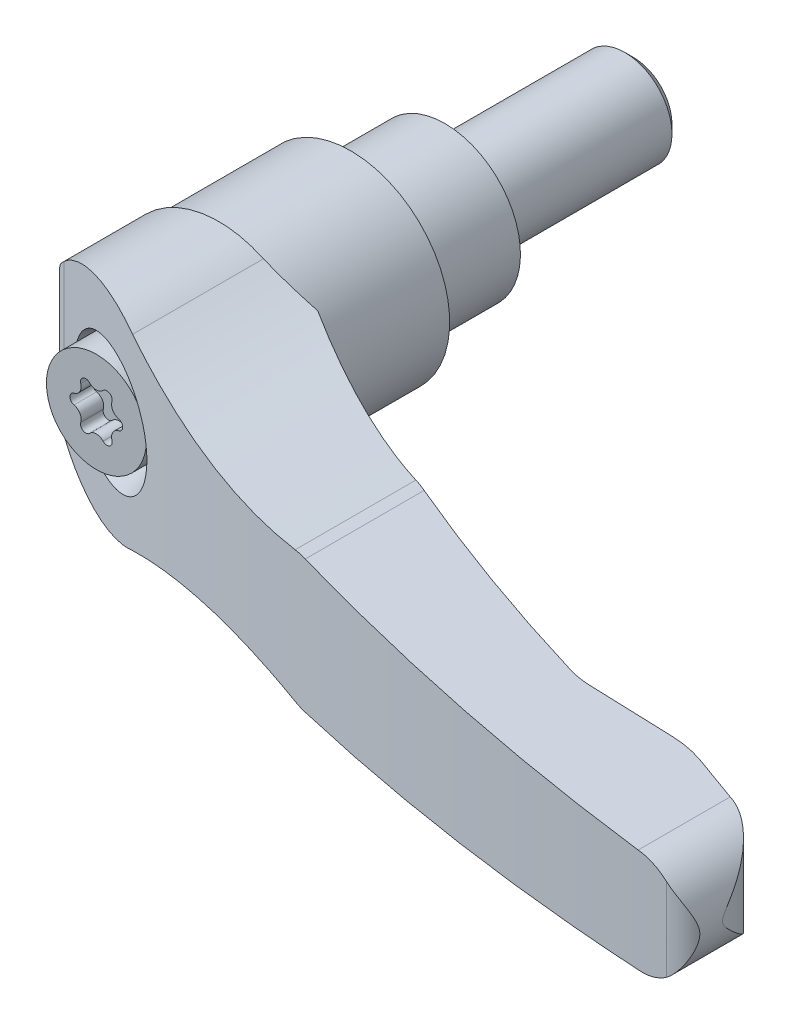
ISO-10303-21;
HEADER;
FILE_DESCRIPTION(('STEP AP214'),'2;1');
FILE_NAME('part.step','',(''),(''),'','','');
FILE_SCHEMA(('AUTOMOTIVE_DESIGN { 1 0 10303 214 1 1 1 1 }'));
ENDSEC;
DATA;
#1=APPLICATION_CONTEXT('core data for automotive mechanical design processes');
#2=APPLICATION_PROTOCOL_DEFINITION('international standard','automotive_design',2000,#1);
#3=PRODUCT_CONTEXT('',#1,'mechanical');
#4=PRODUCT('Part','Part','',(#3));
#5=PRODUCT_RELATED_PRODUCT_CATEGORY('part','',(#4));
#6=PRODUCT_DEFINITION_FORMATION('','',#4);
#7=PRODUCT_DEFINITION_CONTEXT('part definition',#1,'design');
#8=PRODUCT_DEFINITION('design','',#6,#7);
#9=PRODUCT_DEFINITION_SHAPE('','',#8);
#10=(LENGTH_UNIT() NAMED_UNIT(*) SI_UNIT(.MILLI.,.METRE.));
#11=(NAMED_UNIT(*) PLANE_ANGLE_UNIT() SI_UNIT($,.RADIAN.));
#12=(NAMED_UNIT(*) SI_UNIT($,.STERADIAN.) SOLID_ANGLE_UNIT());
#13=UNCERTAINTY_MEASURE_WITH_UNIT(LENGTH_MEASURE(1.E-05),#10,'distance_accuracy_value','');
#14=(GEOMETRIC_REPRESENTATION_CONTEXT(3) GLOBAL_UNCERTAINTY_ASSIGNED_CONTEXT((#13)) GLOBAL_UNIT_ASSIGNED_CONTEXT((#10,
#11,#12)) REPRESENTATION_CONTEXT('',''));
#15=CARTESIAN_POINT('',(0.,0.,0.));
#16=DIRECTION('',(0.,0.,1.));
#17=DIRECTION('',(1.,0.,0.));
#18=AXIS2_PLACEMENT_3D('',#15,#16,#17);
#19=CARTESIAN_POINT('',(2.03924875,0.,-20.));
#20=DIRECTION('',(0.,0.,-1.));
#21=DIRECTION('',(0.,1.,0.));
#22=AXIS2_PLACEMENT_3D('',#19,#20,#21);
#23=PLANE('',#22);
#24=CARTESIAN_POINT('',(0.,0.,-19.9999999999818));
#25=DIRECTION('',(0.,0.,1.));
#26=DIRECTION('',(0.,-1.,0.));
#27=AXIS2_PLACEMENT_3D('',#24,#25,#26);
#28=CIRCLE('',#27,4.07849750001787);
#29=CARTESIAN_POINT('',(0.,-4.07849750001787,-19.9999999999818));
#30=VERTEX_POINT('',#29);
#31=EDGE_CURVE('E677',#30,#30,#28,.T.);
#32=ORIENTED_EDGE('',*,*,#31,.F.);
#33=EDGE_LOOP('',(#32));
#34=FACE_BOUND('',#33,.T.);
#35=ADVANCED_FACE('F14',(#34),#23,.T.);
#36=CARTESIAN_POINT('',(0.,0.,-19.0784975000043));
#37=DIRECTION('',(0.,0.,1.));
#38=DIRECTION('',(0.,-1.,0.));
#39=AXIS2_PLACEMENT_3D('',#36,#37,#38);
#40=CONICAL_SURFACE('',#39,4.99999999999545,0.785398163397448);
#41=CARTESIAN_POINT('',(0.,0.,-19.0784975));
#42=DIRECTION('',(0.,0.,-1.));
#43=DIRECTION('',(0.,1.,0.));
#44=AXIS2_PLACEMENT_3D('',#41,#42,#43);
#45=CIRCLE('',#44,5.);
#46=CARTESIAN_POINT('',(0.,5.,-19.0784975));
#47=VERTEX_POINT('',#46);
#48=EDGE_CURVE('E614',#47,#47,#45,.F.);
#49=ORIENTED_EDGE('',*,*,#48,.F.);
#50=EDGE_LOOP('',(#49));
#51=FACE_BOUND('',#50,.T.);
#52=ORIENTED_EDGE('',*,*,#31,.T.);
#53=EDGE_LOOP('',(#52));
#54=FACE_BOUND('',#53,.T.);
#55=ADVANCED_FACE('F511',(#51,#54),#40,.T.);
#56=CARTESIAN_POINT('',(0.,0.,-9.53924875));
#57=DIRECTION('',(0.,0.,-1.));
#58=DIRECTION('',(0.,1.,0.));
#59=AXIS2_PLACEMENT_3D('',#56,#57,#58);
#60=CYLINDRICAL_SURFACE('',#59,5.);
#61=CARTESIAN_POINT('',(0.,0.,0.));
#62=DIRECTION('',(0.,0.,-1.));
#63=DIRECTION('',(0.,1.,0.));
#64=AXIS2_PLACEMENT_3D('',#61,#62,#63);
#65=CIRCLE('',#64,5.);
#66=CARTESIAN_POINT('',(0.,5.,0.));
#67=VERTEX_POINT('',#66);
#68=EDGE_CURVE('E610',#67,#67,#65,.F.);
#69=ORIENTED_EDGE('',*,*,#68,.F.);
#70=EDGE_LOOP('',(#69));
#71=FACE_BOUND('',#70,.T.);
#72=ORIENTED_EDGE('',*,*,#48,.T.);
#73=EDGE_LOOP('',(#72));
#74=FACE_BOUND('',#73,.T.);
#75=ADVANCED_FACE('F502',(#71,#74),#60,.T.);
#76=CARTESIAN_POINT('',(6.5,0.,0.));
#77=DIRECTION('',(0.,0.,-1.));
#78=DIRECTION('',(0.,1.,0.));
#79=AXIS2_PLACEMENT_3D('',#76,#77,#78);
#80=PLANE('',#79);
#81=ORIENTED_EDGE('',*,*,#68,.T.);
#82=EDGE_LOOP('',(#81));
#83=FACE_BOUND('',#82,.T.);
#84=CARTESIAN_POINT('',(0.,0.,0.));
#85=DIRECTION('',(0.,0.,-1.));
#86=DIRECTION('',(0.,1.,0.));
#87=AXIS2_PLACEMENT_3D('',#84,#85,#86);
#88=CIRCLE('',#87,8.);
#89=CARTESIAN_POINT('',(0.,8.,0.));
#90=VERTEX_POINT('',#89);
#91=EDGE_CURVE('E696',#90,#90,#88,.F.);
#92=ORIENTED_EDGE('',*,*,#91,.F.);
#93=EDGE_LOOP('',(#92));
#94=FACE_BOUND('',#93,.T.);
#95=ADVANCED_FACE('F494',(#83,#94),#80,.T.);
#96=CARTESIAN_POINT('',(0.,0.,11.15));
#97=DIRECTION('',(0.,0.,-1.));
#98=DIRECTION('',(0.,1.,0.));
#99=AXIS2_PLACEMENT_3D('',#96,#97,#98);
#100=CYLINDRICAL_SURFACE('',#99,8.);
#101=ORIENTED_EDGE('',*,*,#91,.T.);
#102=EDGE_LOOP('',(#101));
#103=FACE_BOUND('',#102,.T.);
#104=CARTESIAN_POINT('',(0.,0.,10.7));
#105=DIRECTION('',(0.,0.,-1.));
#106=DIRECTION('',(1.,0.,0.));
#107=AXIS2_PLACEMENT_3D('',#104,#105,#106);
#108=CIRCLE('',#107,8.);
#109=CARTESIAN_POINT('',(8.,0.,10.7));
#110=VERTEX_POINT('',#109);
#111=EDGE_CURVE('E603',#110,#110,#108,.T.);
#112=ORIENTED_EDGE('',*,*,#111,.T.);
#113=EDGE_LOOP('',(#112));
#114=FACE_BOUND('',#113,.T.);
#115=ADVANCED_FACE('F485',(#103,#114),#100,.T.);
#116=CARTESIAN_POINT('',(0.,0.,10.4));
#117=DIRECTION('',(0.,0.,-1.));
#118=DIRECTION('',(0.,1.,0.));
#119=AXIS2_PLACEMENT_3D('',#116,#117,#118);
#120=CONICAL_SURFACE('',#119,8.3,0.785398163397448);
#121=ORIENTED_EDGE('',*,*,#111,.F.);
#122=EDGE_LOOP('',(#121));
#123=FACE_BOUND('',#122,.T.);
#124=CARTESIAN_POINT('',(0.,0.,10.4));
#125=DIRECTION('',(0.,0.,-1.));
#126=DIRECTION('',(0.,1.,0.));
#127=AXIS2_PLACEMENT_3D('',#124,#125,#126);
#128=CIRCLE('',#127,8.3);
#129=CARTESIAN_POINT('',(0.,8.3,10.4));
#130=VERTEX_POINT('',#129);
#131=EDGE_CURVE('E599',#130,#130,#128,.T.);
#132=ORIENTED_EDGE('',*,*,#131,.T.);
#133=EDGE_LOOP('',(#132));
#134=FACE_BOUND('',#133,.T.);
#135=ADVANCED_FACE('F481',(#123,#134),#120,.F.);
#136=CARTESIAN_POINT('',(0.,0.,9.7));
#137=DIRECTION('',(0.,0.,-1.));
#138=DIRECTION('',(0.,1.,0.));
#139=AXIS2_PLACEMENT_3D('',#136,#137,#138);
#140=CYLINDRICAL_SURFACE('',#139,8.3);
#141=ORIENTED_EDGE('',*,*,#131,.F.);
#142=EDGE_LOOP('',(#141));
#143=FACE_BOUND('',#142,.T.);
#144=CARTESIAN_POINT('',(0.,0.,10.));
#145=DIRECTION('',(0.,0.,-1.));
#146=DIRECTION('',(0.,1.,0.));
#147=AXIS2_PLACEMENT_3D('',#144,#145,#146);
#148=CIRCLE('',#147,8.3);
#149=CARTESIAN_POINT('',(0.,8.3,10.));
#150=VERTEX_POINT('',#149);
#151=EDGE_CURVE('E602',#150,#150,#148,.F.);
#152=ORIENTED_EDGE('',*,*,#151,.F.);
#153=EDGE_LOOP('',(#152));
#154=FACE_BOUND('',#153,.T.);
#155=ADVANCED_FACE('F477',(#143,#154),#140,.F.);
#156=CARTESIAN_POINT('',(-5.26,0.,10.));
#157=DIRECTION('',(0.,0.,-1.));
#158=DIRECTION('',(0.,1.,0.));
#159=AXIS2_PLACEMENT_3D('',#156,#157,#158);
#160=PLANE('',#159);
#161=CARTESIAN_POINT('',(-0.00999999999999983,0.,10.));
#162=DIRECTION('',(0.,0.,1.));
#163=DIRECTION('',(-1.,0.,0.));
#164=AXIS2_PLACEMENT_3D('',#161,#162,#163);
#165=CIRCLE('',#164,10.5);
#166=CARTESIAN_POINT('',(-10.2600377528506,-2.27743848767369,10.));
#167=VERTEX_POINT('',#166);
#168=CARTESIAN_POINT('',(-10.2600377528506,2.27743848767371,10.));
#169=VERTEX_POINT('',#168);
#170=EDGE_CURVE('E704',#167,#169,#165,.T.);
#171=ORIENTED_EDGE('',*,*,#170,.F.);
#172=DIRECTION('',(0.,-1.,0.));
#173=VECTOR('',#172,1.);
#174=CARTESIAN_POINT('',(-10.2600377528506,-22.,10.));
#175=LINE('',#174,#173);
#176=EDGE_CURVE('E703',#167,#169,#175,.F.);
#177=ORIENTED_EDGE('',*,*,#176,.T.);
#178=EDGE_LOOP('',(#171,#177));
#179=FACE_BOUND('',#178,.T.);
#180=ORIENTED_EDGE('',*,*,#151,.T.);
#181=EDGE_LOOP('',(#180));
#182=FACE_BOUND('',#181,.T.);
#183=ADVANCED_FACE('F473',(#179,#182),#160,.T.);
#184=CARTESIAN_POINT('',(-10.2600377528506,-22.,10.));
#185=DIRECTION('',(0.707106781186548,0.,0.707106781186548));
#186=DIRECTION('',(-0.707106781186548,0.,0.707106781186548));
#187=AXIS2_PLACEMENT_3D('',#184,#185,#186);
#188=PLANE('',#187);
#189=ORIENTED_EDGE('',*,*,#176,.F.);
#190=CARTESIAN_POINT('',(-0.00999999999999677,0.,-0.250037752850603));
#191=DIRECTION('',(0.707106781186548,0.,0.707106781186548));
#192=DIRECTION('',(-0.707106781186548,0.,0.707106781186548));
#193=AXIS2_PLACEMENT_3D('',#190,#191,#192);
#194=ELLIPSE('',#193,14.8492424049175,10.5);
#195=EDGE_CURVE('E706',#169,#167,#194,.T.);
#196=ORIENTED_EDGE('',*,*,#195,.F.);
#197=EDGE_LOOP('',(#189,#196));
#198=FACE_BOUND('',#197,.T.);
#199=ADVANCED_FACE('F469',(#198),#188,.F.);
#200=CARTESIAN_POINT('',(-0.0100000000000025,0.,18.90625));
#201=DIRECTION('',(0.,0.,1.));
#202=DIRECTION('',(-1.,0.,0.));
#203=AXIS2_PLACEMENT_3D('',#200,#201,#202);
#204=CYLINDRICAL_SURFACE('',#203,10.5);
#205=CARTESIAN_POINT('',(-0.010000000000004,0.,24.));
#206=DIRECTION('',(0.,0.,1.));
#207=DIRECTION('',(-1.,0.,0.));
#208=AXIS2_PLACEMENT_3D('',#205,#206,#207);
#209=CIRCLE('',#208,10.5);
#210=CARTESIAN_POINT('',(-10.51,0.,24.));
#211=VERTEX_POINT('',#210);
#212=CARTESIAN_POINT('',(10.49,0.,24.));
#213=VERTEX_POINT('',#212);
#214=EDGE_CURVE('E454',#211,#213,#209,.T.);
#215=ORIENTED_EDGE('',*,*,#214,.F.);
#216=CARTESIAN_POINT('',(-0.010000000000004,0.,24.));
#217=DIRECTION('',(0.,0.,1.));
#218=DIRECTION('',(-1.,0.,0.));
#219=AXIS2_PLACEMENT_3D('',#216,#217,#218);
#220=CIRCLE('',#219,10.5);
#221=EDGE_CURVE('E585',#213,#211,#220,.T.);
#222=ORIENTED_EDGE('',*,*,#221,.F.);
#223=EDGE_LOOP('',(#215,#222));
#224=FACE_BOUND('',#223,.T.);
#225=ORIENTED_EDGE('',*,*,#170,.T.);
#226=ORIENTED_EDGE('',*,*,#195,.T.);
#227=EDGE_LOOP('',(#225,#226));
#228=FACE_BOUND('',#227,.T.);
#229=ADVANCED_FACE('F465',(#224,#228),#204,.T.);
#230=CARTESIAN_POINT('',(-10.51,-12.,24.));
#231=DIRECTION('',(0.,0.,-1.));
#232=DIRECTION('',(0.,1.,0.));
#233=AXIS2_PLACEMENT_3D('',#230,#231,#232);
#234=PLANE('',#233);
#235=ORIENTED_EDGE('',*,*,#214,.T.);
#236=DIRECTION('',(0.,-1.,0.));
#237=VECTOR('',#236,1.);
#238=CARTESIAN_POINT('',(10.4900000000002,-12.,23.9999999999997));
#239=LINE('',#238,#237);
#240=CARTESIAN_POINT('',(10.4900000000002,-8.03465812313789,24.));
#241=VERTEX_POINT('',#240);
#242=EDGE_CURVE('E440',#213,#241,#239,.T.);
#243=ORIENTED_EDGE('',*,*,#242,.T.);
#244=CARTESIAN_POINT('',(22.94,-55.53,24.));
#245=DIRECTION('',(0.,0.,1.));
#246=DIRECTION('',(0.,-1.,0.));
#247=AXIS2_PLACEMENT_3D('',#244,#245,#246);
#248=CIRCLE('',#247,49.1);
#249=CARTESIAN_POINT('',(4.72251026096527,-9.93468151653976,24.));
#250=VERTEX_POINT('',#249);
#251=EDGE_CURVE('E743',#241,#250,#248,.T.);
#252=ORIENTED_EDGE('',*,*,#251,.T.);
#253=CARTESIAN_POINT('',(0.,0.,24.));
#254=DIRECTION('',(0.,0.,1.));
#255=DIRECTION('',(0.,-1.,0.));
#256=AXIS2_PLACEMENT_3D('',#253,#254,#255);
#257=CIRCLE('',#256,11.);
#258=CARTESIAN_POINT('',(-10.51,-3.24652121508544,24.));
#259=VERTEX_POINT('',#258);
#260=EDGE_CURVE('E737',#259,#250,#257,.T.);
#261=ORIENTED_EDGE('',*,*,#260,.F.);
#262=DIRECTION('',(0.,-1.,0.));
#263=VECTOR('',#262,1.);
#264=CARTESIAN_POINT('',(-10.51,-12.,24.));
#265=LINE('',#264,#263);
#266=EDGE_CURVE('E584',#211,#259,#265,.T.);
#267=ORIENTED_EDGE('',*,*,#266,.F.);
#268=EDGE_LOOP('',(#235,#243,#252,#261,#267));
#269=FACE_BOUND('',#268,.T.);
#270=ADVANCED_FACE('F460',(#269),#234,.T.);
#271=CARTESIAN_POINT('',(31.3589689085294,0.945932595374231,54.5));
#272=DIRECTION('',(0.,0.,1.));
#273=DIRECTION('',(0.,-1.,0.));
#274=AXIS2_PLACEMENT_3D('',#271,#272,#273);
#275=CYLINDRICAL_SURFACE('',#274,8.00000000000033);
#276=CARTESIAN_POINT('',(31.6479325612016,-7.04884695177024,46.4731806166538));
#277=CARTESIAN_POINT('',(31.4018180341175,-7.05768532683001,46.4087993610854));
#278=CARTESIAN_POINT('',(31.1563854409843,-7.05525330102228,46.3442255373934));
#279=CARTESIAN_POINT('',(30.66688412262,-7.02784844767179,46.2146927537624));
#280=CARTESIAN_POINT('',(30.4228153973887,-7.00287562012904,46.1497337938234));
#281=CARTESIAN_POINT('',(30.1794286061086,-6.96663239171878,46.0845822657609));
#282=B_SPLINE_CURVE_WITH_KNOTS('',3,(#276,#277,#278,#279,#280,#281),.UNSPECIFIED.,.F.,.F.,(4,2,
4),(0.,0.76139061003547,1.52278122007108),.UNSPECIFIED.);
#283=CARTESIAN_POINT('',(31.6479325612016,-7.04884695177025,46.4731806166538));
#284=VERTEX_POINT('',#283);
#285=CARTESIAN_POINT('',(30.1794286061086,-6.96663239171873,46.084582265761));
#286=VERTEX_POINT('',#285);
#287=EDGE_CURVE('E447',#284,#286,#282,.T.);
#288=ORIENTED_EDGE('',*,*,#287,.T.);
#289=DIRECTION('',(0.,0.,1.));
#290=VECTOR('',#289,1.);
#291=CARTESIAN_POINT('',(30.1794286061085,-6.96663239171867,54.5));
#292=LINE('',#291,#290);
#293=CARTESIAN_POINT('',(30.1794286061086,-6.96663239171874,33.2732494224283));
#294=VERTEX_POINT('',#293);
#295=EDGE_CURVE('E738',#286,#294,#292,.F.);
#296=ORIENTED_EDGE('',*,*,#295,.T.);
#297=CARTESIAN_POINT('',(30.1794286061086,-6.9666323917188,33.2732494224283));
#298=CARTESIAN_POINT('',(30.4222007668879,-7.00282816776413,33.3728739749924));
#299=CARTESIAN_POINT('',(30.6665043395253,-7.02781937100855,33.4725985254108));
#300=CARTESIAN_POINT('',(31.0339219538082,-7.04840105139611,33.6217860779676));
#301=CARTESIAN_POINT('',(31.1565128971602,-7.05244559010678,33.6714318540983));
#302=CARTESIAN_POINT('',(31.4020580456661,-7.05489552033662,33.7706062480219));
#303=CARTESIAN_POINT('',(31.5250125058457,-7.05329063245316,33.8201344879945));
#304=CARTESIAN_POINT('',(31.6479325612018,-7.04884695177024,33.8695155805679));
#305=B_SPLINE_CURVE_WITH_KNOTS('',3,(#297,#298,#299,#300,#301,#302,#303,#304),.UNSPECIFIED.,.F.,
.F.,(4,2,2,4),(0.,0.794258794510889,1.19111760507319,1.58869889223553),.UNSPECIFIED.);
#306=CARTESIAN_POINT('',(31.6479325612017,-7.04884695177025,33.8695155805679));
#307=VERTEX_POINT('',#306);
#308=EDGE_CURVE('E442',#294,#307,#305,.T.);
#309=ORIENTED_EDGE('',*,*,#308,.T.);
#310=DIRECTION('',(0.,0.,1.));
#311=VECTOR('',#310,1.);
#312=CARTESIAN_POINT('',(31.6479325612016,-7.04884695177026,54.5));
#313=LINE('',#312,#311);
#314=EDGE_CURVE('E748',#307,#284,#313,.T.);
#315=ORIENTED_EDGE('',*,*,#314,.T.);
#316=EDGE_LOOP('',(#288,#296,#309,#315));
#317=FACE_BOUND('',#316,.T.);
#318=ADVANCED_FACE('F456',(#317),#275,.T.);
#319=CARTESIAN_POINT('',(79.9967051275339,-12.,50.5395921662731));
#320=DIRECTION('',(0.992331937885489,0.,-0.123601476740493));
#321=DIRECTION('',(0.123601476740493,0.,0.992331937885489));
#322=AXIS2_PLACEMENT_3D('',#319,#320,#321);
#323=PLANE('',#322);
#324=CARTESIAN_POINT('',(79.9967051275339,-0.190348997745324,50.5395921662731));
#325=CARTESIAN_POINT('',(79.9969785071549,-0.182455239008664,50.5417867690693));
#326=CARTESIAN_POINT('',(79.9972360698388,-0.174525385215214,50.543854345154));
#327=CARTESIAN_POINT('',(79.9977166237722,-0.158664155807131,50.5477118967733));
#328=CARTESIAN_POINT('',(79.9979398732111,-0.150733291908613,50.5495039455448));
#329=CARTESIAN_POINT('',(79.9983518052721,-0.134870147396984,50.5528105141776));
#330=CARTESIAN_POINT('',(79.998540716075,-0.12693825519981,50.5543268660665));
#331=CARTESIAN_POINT('',(79.9988840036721,-0.111073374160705,50.5570823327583));
#332=CARTESIAN_POINT('',(79.9990385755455,-0.103140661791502,50.5583230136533));
#333=CARTESIAN_POINT('',(79.9993132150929,-0.087274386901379,50.5605274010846));
#334=CARTESIAN_POINT('',(79.9994334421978,-0.0793410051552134,50.5614923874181));
#335=CARTESIAN_POINT('',(79.9996394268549,-0.0634736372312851,50.5631456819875));
#336=CARTESIAN_POINT('',(79.9997253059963,-0.0555397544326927,50.5638349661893));
#337=CARTESIAN_POINT('',(79.9998626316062,-0.0396716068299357,50.5649371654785));
#338=CARTESIAN_POINT('',(79.9999141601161,-0.0317373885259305,50.5653507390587));
#339=CARTESIAN_POINT('',(79.9999828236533,-0.0158687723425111,50.5659018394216));
#340=CARTESIAN_POINT('',(80.,-0.00793438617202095,50.5660396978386));
#341=CARTESIAN_POINT('',(80.,0.00793438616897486,50.5660396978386));
#342=CARTESIAN_POINT('',(79.9999828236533,0.0158687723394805,50.5659018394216));
#343=CARTESIAN_POINT('',(79.9999141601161,0.0317373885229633,50.5653507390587));
#344=CARTESIAN_POINT('',(79.9998626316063,0.0396716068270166,50.5649371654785));
#345=CARTESIAN_POINT('',(79.9997253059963,0.0555397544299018,50.5638349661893));
#346=CARTESIAN_POINT('',(79.9996394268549,0.0634736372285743,50.5631456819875));
#347=CARTESIAN_POINT('',(79.9994334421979,0.0793410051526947,50.5614923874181));
#348=CARTESIAN_POINT('',(79.9993132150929,0.0872743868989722,50.5605274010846));
#349=CARTESIAN_POINT('',(79.9990385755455,0.103140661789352,50.5583230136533));
#350=CARTESIAN_POINT('',(79.9988840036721,0.111073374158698,50.5570823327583));
#351=CARTESIAN_POINT('',(79.998540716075,0.126938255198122,50.5543268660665));
#352=CARTESIAN_POINT('',(79.9983518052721,0.134870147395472,50.5528105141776));
#353=CARTESIAN_POINT('',(79.9979398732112,0.150733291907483,50.5495039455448));
#354=CARTESIAN_POINT('',(79.9977166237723,0.158664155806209,50.5477118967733));
#355=CARTESIAN_POINT('',(79.9972360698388,0.174525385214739,50.543854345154));
#356=CARTESIAN_POINT('',(79.9969785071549,0.182455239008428,50.5417867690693));
#357=CARTESIAN_POINT('',(79.9967051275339,0.190348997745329,50.5395921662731));
#358=B_SPLINE_CURVE_WITH_KNOTS('',3,(#324,#325,#326,#327,#328,#329,#330,#331,#332,#333,#334,
#335,#336,#337,#338,#339,#340,#341,#342,#343,#344,#345,#346,#347,#348,#349,#350,#351,#352,#353,
#354,#355,#356,#357),.UNSPECIFIED.,.F.,.F.,(4,2,2,2,2,2,2,2,2,2,2,2,2,2,2,2,4),(0.,
0.0245923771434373,0.0489895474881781,0.0732181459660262,0.0973053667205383,0.121278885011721,
0.145166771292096,0.168997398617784,0.19279934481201,0.216601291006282,0.240431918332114,
0.264319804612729,0.288293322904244,0.312380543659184,0.336609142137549,0.361006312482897,
0.385598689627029),.UNSPECIFIED.);
#359=CARTESIAN_POINT('',(79.9967051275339,-0.190348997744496,50.5395921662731));
#360=VERTEX_POINT('',#359);
#361=CARTESIAN_POINT('',(79.9967051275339,0.190348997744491,50.5395921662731));
#362=VERTEX_POINT('',#361);
#363=EDGE_CURVE('E368',#360,#362,#358,.T.);
#364=ORIENTED_EDGE('',*,*,#363,.F.);
#365=DIRECTION('',(0.,-1.,0.));
#366=VECTOR('',#365,1.);
#367=CARTESIAN_POINT('',(79.9967051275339,-12.,50.5395921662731));
#368=LINE('',#367,#366);
#369=EDGE_CURVE('E453',#362,#360,#368,.T.);
#370=ORIENTED_EDGE('',*,*,#369,.F.);
#371=EDGE_LOOP('',(#364,#370));
#372=FACE_BOUND('',#371,.T.);
#373=ADVANCED_FACE('F397',(#372),#323,.T.);
#374=CARTESIAN_POINT('',(72.6137555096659,-12.,51.4591871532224));
#375=DIRECTION('',(0.,-1.,0.));
#376=DIRECTION('',(1.,0.,0.));
#377=AXIS2_PLACEMENT_3D('',#374,#375,#376);
#378=CYLINDRICAL_SURFACE('',#377,7.44);
#379=CARTESIAN_POINT('',(79.9967051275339,0.190348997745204,50.5395921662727));
#380=CARTESIAN_POINT('',(79.9951469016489,0.235214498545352,50.5270575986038));
#381=CARTESIAN_POINT('',(79.9930953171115,0.27873685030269,50.5108629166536));
#382=CARTESIAN_POINT('',(79.988164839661,0.363077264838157,50.4732708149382));
#383=CARTESIAN_POINT('',(79.9852922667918,0.40391316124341,50.4519133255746));
#384=CARTESIAN_POINT('',(79.975702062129,0.52245816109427,50.3833482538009));
#385=CARTESIAN_POINT('',(79.9679715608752,0.597169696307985,50.3312876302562));
#386=CARTESIAN_POINT('',(79.9508869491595,0.736456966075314,50.2251559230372));
#387=CARTESIAN_POINT('',(79.9416856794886,0.801375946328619,50.1714851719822));
#388=CARTESIAN_POINT('',(79.9214540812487,0.928420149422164,50.0612288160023));
#389=CARTESIAN_POINT('',(79.9104232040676,0.990544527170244,50.0046423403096));
#390=CARTESIAN_POINT('',(79.8746515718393,1.17419942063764,49.8323129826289));
#391=CARTESIAN_POINT('',(79.8472488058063,1.29287988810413,49.7141099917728));
#392=CARTESIAN_POINT('',(79.7848398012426,1.52823594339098,49.4729704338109));
#393=CARTESIAN_POINT('',(79.7496926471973,1.64482416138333,49.3499864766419));
#394=CARTESIAN_POINT('',(79.6721004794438,1.87458318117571,49.1033284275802));
#395=CARTESIAN_POINT('',(79.6296610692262,1.98775652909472,48.9796549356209));
#396=CARTESIAN_POINT('',(79.5033816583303,2.29352791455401,48.6415502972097));
#397=CARTESIAN_POINT('',(79.4120558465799,2.48329449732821,48.427296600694));
#398=CARTESIAN_POINT('',(79.2061355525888,2.85434488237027,48.0023120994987));
#399=CARTESIAN_POINT('',(79.0915236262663,3.03562219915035,47.7915840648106));
#400=CARTESIAN_POINT('',(78.8390032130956,3.38665877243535,47.3777391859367));
#401=CARTESIAN_POINT('',(78.7012752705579,3.5564939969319,47.1745772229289));
#402=CARTESIAN_POINT('',(78.4009143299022,3.88356808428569,46.7768350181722));
#403=CARTESIAN_POINT('',(78.2383021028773,4.04081728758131,46.5822477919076));
#404=CARTESIAN_POINT('',(77.9568022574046,4.2801698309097,46.2794503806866));
#405=CARTESIAN_POINT('',(77.8461272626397,4.36735584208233,46.1675710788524));
#406=CARTESIAN_POINT('',(77.61512986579,4.53501217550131,45.9487274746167));
#407=CARTESIAN_POINT('',(77.494805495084,4.61548112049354,45.8417641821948));
#408=CARTESIAN_POINT('',(77.2447591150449,4.7684092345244,45.6339165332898));
#409=CARTESIAN_POINT('',(77.1150589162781,4.84088606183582,45.5330190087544));
#410=CARTESIAN_POINT('',(76.8461728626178,4.97676025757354,45.3380932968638));
#411=CARTESIAN_POINT('',(76.7069926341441,5.04016294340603,45.2440611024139));
#412=CARTESIAN_POINT('',(76.4438690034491,5.14664435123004,45.0792448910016));
#413=CARTESIAN_POINT('',(76.3213555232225,5.19134589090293,45.0072256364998));
#414=CARTESIAN_POINT('',(76.0703754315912,5.27269544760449,44.8693561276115));
#415=CARTESIAN_POINT('',(75.9419112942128,5.30934677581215,44.8035033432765));
#416=CARTESIAN_POINT('',(75.678496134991,5.37397975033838,44.6781572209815));
#417=CARTESIAN_POINT('',(75.5435027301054,5.40189236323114,44.6187168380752));
#418=CARTESIAN_POINT('',(75.2686009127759,5.44782102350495,44.507386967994));
#419=CARTESIAN_POINT('',(75.1286862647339,5.46582399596,44.4555075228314));
#420=CARTESIAN_POINT('',(74.9868127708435,5.47841339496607,44.407790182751));
#421=B_SPLINE_CURVE_WITH_KNOTS('',3,(#379,#380,#381,#382,#383,#384,#385,#386,#387,#388,#389,
#390,#391,#392,#393,#394,#395,#396,#397,#398,#399,#400,#401,#402,#403,#404,#405,#406,#407,#408,
#409,#410,#411,#412,#413,#414,#415,#416,#417,#418,#419,#420),.UNSPECIFIED.,.F.,.F.,(4,2,2,2,2,2,
2,2,2,2,2,2,2,2,2,2,2,2,2,2,4),(0.,0.139245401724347,0.277446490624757,0.550810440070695,
0.804906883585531,1.05907965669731,1.56794086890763,2.08696422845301,2.60559053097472,
3.50582150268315,4.40672935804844,5.30090298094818,6.1943342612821,6.73367946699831,
7.27313498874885,7.81137365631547,8.3492956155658,8.79580649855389,9.24213337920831,
9.69190199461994,10.1422626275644),.UNSPECIFIED.);
#422=CARTESIAN_POINT('',(74.9868127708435,5.47841339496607,44.407790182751));
#423=VERTEX_POINT('',#422);
#424=EDGE_CURVE('E385',#362,#423,#421,.T.);
#425=ORIENTED_EDGE('',*,*,#424,.F.);
#426=ORIENTED_EDGE('',*,*,#369,.T.);
#427=CARTESIAN_POINT('',(74.9868127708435,-5.47841339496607,44.407790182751));
#428=CARTESIAN_POINT('',(75.1398120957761,-5.46484028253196,44.459242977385));
#429=CARTESIAN_POINT('',(75.2905169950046,-5.44496899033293,44.5155387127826));
#430=CARTESIAN_POINT('',(75.5860882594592,-5.39377415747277,44.6368581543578));
#431=CARTESIAN_POINT('',(75.7309637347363,-5.36246932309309,44.7018674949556));
#432=CARTESIAN_POINT('',(76.0125967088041,-5.28989557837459,44.8390817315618));
#433=CARTESIAN_POINT('',(76.1494251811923,-5.24873835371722,44.9112009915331));
#434=CARTESIAN_POINT('',(76.4161065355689,-5.15736483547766,45.0623731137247));
#435=CARTESIAN_POINT('',(76.5459558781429,-5.10714400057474,45.1414294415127));
#436=CARTESIAN_POINT('',(76.8276536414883,-4.98604991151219,45.3247681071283));
#437=CARTESIAN_POINT('',(76.9775772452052,-4.91309116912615,45.4306358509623));
#438=CARTESIAN_POINT('',(77.265789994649,-4.75681575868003,45.6501400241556));
#439=CARTESIAN_POINT('',(77.4040776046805,-4.67349772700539,45.7637774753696));
#440=CARTESIAN_POINT('',(77.8028296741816,-4.40945601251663,46.1156758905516));
#441=CARTESIAN_POINT('',(78.0457801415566,-4.21527563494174,46.3639882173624));
#442=CARTESIAN_POINT('',(78.417694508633,-3.86589184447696,46.7984433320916));
#443=CARTESIAN_POINT('',(78.5586476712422,-3.71726415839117,46.9799982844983));
#444=CARTESIAN_POINT('',(78.8199419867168,-3.41009407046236,47.3496806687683));
#445=CARTESIAN_POINT('',(78.940273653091,-3.25154715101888,47.537811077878));
#446=CARTESIAN_POINT('',(79.1607378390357,-2.92676895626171,47.9181651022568));
#447=CARTESIAN_POINT('',(79.2609186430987,-2.76055725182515,48.1103776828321));
#448=CARTESIAN_POINT('',(79.4421677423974,-2.42115236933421,48.4974286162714));
#449=CARTESIAN_POINT('',(79.5232445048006,-2.24796232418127,48.692265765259));
#450=CARTESIAN_POINT('',(79.6578968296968,-1.91676087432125,49.0578102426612));
#451=CARTESIAN_POINT('',(79.7136489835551,-1.75958096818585,49.2284695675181));
#452=CARTESIAN_POINT('',(79.786963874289,-1.51825146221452,49.4826945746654));
#453=CARTESIAN_POINT('',(79.8097141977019,-1.43673320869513,49.567289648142));
#454=CARTESIAN_POINT('',(79.8517302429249,-1.27132927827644,49.7350141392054));
#455=CARTESIAN_POINT('',(79.870996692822,-1.18744410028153,49.8181438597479));
#456=CARTESIAN_POINT('',(79.9071865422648,-1.01046435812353,49.9869732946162));
#457=CARTESIAN_POINT('',(79.9238666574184,-0.917129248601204,50.0724723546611));
#458=CARTESIAN_POINT('',(79.9529450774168,-0.724505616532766,50.2358460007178));
#459=CARTESIAN_POINT('',(79.9653823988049,-0.625281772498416,50.3137850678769));
#460=CARTESIAN_POINT('',(79.9802376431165,-0.468580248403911,50.4153149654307));
#461=CARTESIAN_POINT('',(79.9845030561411,-0.416215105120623,50.4460963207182));
#462=CARTESIAN_POINT('',(79.9917045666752,-0.30687937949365,50.4998809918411));
#463=CARTESIAN_POINT('',(79.9946243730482,-0.249861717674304,50.5227881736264));
#464=CARTESIAN_POINT('',(79.9967051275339,-0.190348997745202,50.5395921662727));
#465=B_SPLINE_CURVE_WITH_KNOTS('',3,(#427,#428,#429,#430,#431,#432,#433,#434,#435,#436,#437,
#438,#439,#440,#441,#442,#443,#444,#445,#446,#447,#448,#449,#450,#451,#452,#453,#454,#455,#456,
#457,#458,#459,#460,#461,#462,#463,#464),.UNSPECIFIED.,.F.,.F.,(4,2,2,2,2,2,2,2,2,2,2,2,2,2,2,2,
2,2,4),(0.,0.485611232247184,0.970431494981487,1.44999646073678,1.92980238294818,
2.52141817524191,3.11311192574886,4.30183389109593,5.12208341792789,5.94270927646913,
6.76134473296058,7.57961667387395,8.29494630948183,8.65387747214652,9.01273353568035,
9.39561932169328,9.77488268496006,9.95698827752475,10.141244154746),.UNSPECIFIED.);
#466=CARTESIAN_POINT('',(74.9868127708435,-5.47841339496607,44.407790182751));
#467=VERTEX_POINT('',#466);
#468=EDGE_CURVE('E357',#467,#360,#465,.T.);
#469=ORIENTED_EDGE('',*,*,#468,.F.);
#470=DIRECTION('',(0.,-1.,0.));
#471=VECTOR('',#470,1.);
#472=CARTESIAN_POINT('',(74.9868127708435,-12.,44.407790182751));
#473=LINE('',#472,#471);
#474=EDGE_CURVE('E441',#423,#467,#473,.T.);
#475=ORIENTED_EDGE('',*,*,#474,.F.);
#476=EDGE_LOOP('',(#425,#426,#469,#475));
#477=FACE_BOUND('',#476,.T.);
#478=ADVANCED_FACE('F391',(#477),#378,.T.);
#479=CARTESIAN_POINT('',(57.3760512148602,-12.,33.47));
#480=DIRECTION('',(0.,-1.,0.));
#481=DIRECTION('',(1.,0.,0.));
#482=AXIS2_PLACEMENT_3D('',#479,#480,#481);
#483=CYLINDRICAL_SURFACE('',#482,8.58999999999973);
#484=DIRECTION('',(0.,-1.,0.));
#485=VECTOR('',#484,1.);
#486=CARTESIAN_POINT('',(55.1138126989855,-12.,41.756759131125));
#487=LINE('',#486,#485);
#488=CARTESIAN_POINT('',(55.1138126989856,-6.20069518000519,41.7567591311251));
#489=VERTEX_POINT('',#488);
#490=CARTESIAN_POINT('',(55.1138126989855,6.2006951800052,41.7567591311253));
#491=VERTEX_POINT('',#490);
#492=EDGE_CURVE('E732',#489,#491,#487,.F.);
#493=ORIENTED_EDGE('',*,*,#492,.T.);
#494=CARTESIAN_POINT('',(57.3760512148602,6.11892873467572,33.47));
#495=DIRECTION('',(-0.0361204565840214,-0.999347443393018,0.));
#496=DIRECTION('',(0.999347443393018,-0.0361204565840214,0.));
#497=AXIS2_PLACEMENT_3D('',#494,#495,#496);
#498=ELLIPSE('',#497,8.59560912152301,8.58999999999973);
#499=CARTESIAN_POINT('',(57.3760512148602,6.11892873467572,42.06));
#500=VERTEX_POINT('',#499);
#501=EDGE_CURVE('E813',#491,#500,#498,.F.);
#502=ORIENTED_EDGE('',*,*,#501,.T.);
#503=DIRECTION('',(0.,1.,0.));
#504=VECTOR('',#503,1.);
#505=CARTESIAN_POINT('',(57.3760512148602,-12.,42.06));
#506=LINE('',#505,#504);
#507=CARTESIAN_POINT('',(57.3760512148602,-6.11892873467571,42.06));
#508=VERTEX_POINT('',#507);
#509=EDGE_CURVE('E590',#508,#500,#506,.T.);
#510=ORIENTED_EDGE('',*,*,#509,.F.);
#511=CARTESIAN_POINT('',(57.3760512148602,-6.11892873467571,33.47));
#512=DIRECTION('',(-0.0361204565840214,0.999347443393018,0.));
#513=DIRECTION('',(-0.999347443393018,-0.0361204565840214,0.));
#514=AXIS2_PLACEMENT_3D('',#511,#512,#513);
#515=ELLIPSE('',#514,8.59560912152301,8.58999999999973);
#516=EDGE_CURVE('E753',#508,#489,#515,.F.);
#517=ORIENTED_EDGE('',*,*,#516,.T.);
#518=EDGE_LOOP('',(#493,#502,#510,#517));
#519=FACE_BOUND('',#518,.T.);
#520=ADVANCED_FACE('F396',(#519),#483,.F.);
#521=CARTESIAN_POINT('',(57.3760512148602,-12.,42.06));
#522=DIRECTION('',(0.,0.,-1.));
#523=DIRECTION('',(0.,1.,0.));
#524=AXIS2_PLACEMENT_3D('',#521,#522,#523);
#525=PLANE('',#524);
#526=DIRECTION('',(0.999347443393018,-0.0361204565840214,0.));
#527=VECTOR('',#526,1.);
#528=CARTESIAN_POINT('',(31.6479325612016,7.04884695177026,42.06));
#529=LINE('',#528,#527);
#530=CARTESIAN_POINT('',(66.1633245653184,5.80132115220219,42.06));
#531=VERTEX_POINT('',#530);
#532=EDGE_CURVE('E810',#500,#531,#529,.T.);
#533=ORIENTED_EDGE('',*,*,#532,.T.);
#534=DIRECTION('',(0.,-1.,0.));
#535=VECTOR('',#534,1.);
#536=CARTESIAN_POINT('',(66.1633245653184,-12.,42.06));
#537=LINE('',#536,#535);
#538=CARTESIAN_POINT('',(66.1633245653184,-5.80132115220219,42.06));
#539=VERTEX_POINT('',#538);
#540=EDGE_CURVE('E589',#539,#531,#537,.F.);
#541=ORIENTED_EDGE('',*,*,#540,.F.);
#542=DIRECTION('',(-0.999347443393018,-0.0361204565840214,0.));
#543=VECTOR('',#542,1.);
#544=CARTESIAN_POINT('',(74.5,-5.5,42.06));
#545=LINE('',#544,#543);
#546=EDGE_CURVE('E751',#539,#508,#545,.T.);
#547=ORIENTED_EDGE('',*,*,#546,.T.);
#548=ORIENTED_EDGE('',*,*,#509,.T.);
#549=EDGE_LOOP('',(#533,#541,#547,#548));
#550=FACE_BOUND('',#549,.T.);
#551=ADVANCED_FACE('F403',(#550),#525,.T.);
#552=CARTESIAN_POINT('',(66.1633245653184,-12.,53.34));
#553=DIRECTION('',(0.,-1.,0.));
#554=DIRECTION('',(1.,0.,0.));
#555=AXIS2_PLACEMENT_3D('',#552,#553,#554);
#556=CYLINDRICAL_SURFACE('',#555,11.2800000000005);
#557=CARTESIAN_POINT('',(66.1633245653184,5.80132115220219,53.34));
#558=DIRECTION('',(-0.0361204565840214,-0.999347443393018,0.));
#559=DIRECTION('',(0.999347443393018,-0.0361204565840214,0.));
#560=AXIS2_PLACEMENT_3D('',#557,#558,#559);
#561=ELLIPSE('',#560,11.2873656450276,11.2800000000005);
#562=CARTESIAN_POINT('',(69.7611855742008,5.6712799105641,42.6491723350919));
#563=VERTEX_POINT('',#562);
#564=EDGE_CURVE('E812',#531,#563,#561,.T.);
#565=ORIENTED_EDGE('',*,*,#564,.T.);
#566=DIRECTION('',(0.,-1.,0.));
#567=VECTOR('',#566,1.);
#568=CARTESIAN_POINT('',(69.7611855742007,-12.,42.6491723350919));
#569=LINE('',#568,#567);
#570=CARTESIAN_POINT('',(69.7611855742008,-5.6712799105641,42.6491723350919));
#571=VERTEX_POINT('',#570);
#572=EDGE_CURVE('E586',#571,#563,#569,.F.);
#573=ORIENTED_EDGE('',*,*,#572,.F.);
#574=CARTESIAN_POINT('',(66.1633245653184,-5.80132115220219,53.34));
#575=DIRECTION('',(-0.0361204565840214,0.999347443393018,0.));
#576=DIRECTION('',(-0.999347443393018,-0.0361204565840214,0.));
#577=AXIS2_PLACEMENT_3D('',#574,#575,#576);
#578=ELLIPSE('',#577,11.2873656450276,11.2800000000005);
#579=EDGE_CURVE('E754',#571,#539,#578,.T.);
#580=ORIENTED_EDGE('',*,*,#579,.T.);
#581=ORIENTED_EDGE('',*,*,#540,.T.);
#582=EDGE_LOOP('',(#565,#573,#580,#581));
#583=FACE_BOUND('',#582,.T.);
#584=ADVANCED_FACE('F407',(#583),#556,.T.);
#585=CARTESIAN_POINT('',(69.7611855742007,-12.,42.6491723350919));
#586=DIRECTION('',(0.318959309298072,0.,-0.947768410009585));
#587=DIRECTION('',(0.947768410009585,0.,0.318959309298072));
#588=AXIS2_PLACEMENT_3D('',#585,#586,#587);
#589=PLANE('',#588);
#590=ORIENTED_EDGE('',*,*,#474,.T.);
#591=CARTESIAN_POINT('',(74.5,0.,44.2439595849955));
#592=DIRECTION('',(0.318959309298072,0.,-0.947768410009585));
#593=DIRECTION('',(0.947768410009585,0.,0.318959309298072));
#594=AXIS2_PLACEMENT_3D('',#591,#592,#593);
#595=ELLIPSE('',#594,5.80310542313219,5.5);
#596=CARTESIAN_POINT('',(74.5,-5.5,44.2439595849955));
#597=VERTEX_POINT('',#596);
#598=EDGE_CURVE('E747',#597,#467,#595,.F.);
#599=ORIENTED_EDGE('',*,*,#598,.F.);
#600=DIRECTION('',(-0.947212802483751,-0.0342360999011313,-0.318772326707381));
#601=VECTOR('',#600,1.);
#602=CARTESIAN_POINT('',(74.5,-5.5,44.2439595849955));
#603=LINE('',#602,#601);
#604=EDGE_CURVE('E744',#597,#571,#603,.T.);
#605=ORIENTED_EDGE('',*,*,#604,.T.);
#606=ORIENTED_EDGE('',*,*,#572,.T.);
#607=DIRECTION('',(0.947212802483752,-0.0342360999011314,0.31877232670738));
#608=VECTOR('',#607,1.);
#609=CARTESIAN_POINT('',(69.7611855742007,5.6712799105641,42.6491723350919));
#610=LINE('',#609,#608);
#611=CARTESIAN_POINT('',(74.5,5.5,44.2439595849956));
#612=VERTEX_POINT('',#611);
#613=EDGE_CURVE('E806',#563,#612,#610,.T.);
#614=ORIENTED_EDGE('',*,*,#613,.T.);
#615=CARTESIAN_POINT('',(74.5,0.,44.2439595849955));
#616=DIRECTION('',(0.318959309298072,0.,-0.947768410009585));
#617=DIRECTION('',(0.947768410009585,0.,0.318959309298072));
#618=AXIS2_PLACEMENT_3D('',#615,#616,#617);
#619=ELLIPSE('',#618,5.80310542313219,5.5);
#620=EDGE_CURVE('E382',#423,#612,#619,.F.);
#621=ORIENTED_EDGE('',*,*,#620,.F.);
#622=EDGE_LOOP('',(#590,#599,#605,#606,#614,#621));
#623=FACE_BOUND('',#622,.T.);
#624=ADVANCED_FACE('F411',(#623),#589,.T.);
#625=CARTESIAN_POINT('',(31.3589689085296,-0.945932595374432,54.5));
#626=DIRECTION('',(0.,0.,1.));
#627=DIRECTION('',(0.,-1.,0.));
#628=AXIS2_PLACEMENT_3D('',#625,#626,#627);
#629=CYLINDRICAL_SURFACE('',#628,8.00000000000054);
#630=CARTESIAN_POINT('',(30.1794286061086,6.96663239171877,46.0845822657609));
#631=CARTESIAN_POINT('',(30.4228153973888,7.00287562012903,46.1497337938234));
#632=CARTESIAN_POINT('',(30.66688412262,7.02784844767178,46.2146927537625));
#633=CARTESIAN_POINT('',(31.1563854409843,7.05525330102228,46.3442255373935));
#634=CARTESIAN_POINT('',(31.4018180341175,7.05768532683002,46.4087993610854));
#635=CARTESIAN_POINT('',(31.6479325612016,7.04884695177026,46.4731806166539));
#636=B_SPLINE_CURVE_WITH_KNOTS('',3,(#630,#631,#632,#633,#634,#635),.UNSPECIFIED.,.F.,.F.,(4,2,
4),(0.,0.761390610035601,1.52278122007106),.UNSPECIFIED.);
#637=CARTESIAN_POINT('',(30.1794286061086,6.96663239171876,46.0845822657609));
#638=VERTEX_POINT('',#637);
#639=CARTESIAN_POINT('',(31.6479325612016,7.04884695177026,46.4731806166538));
#640=VERTEX_POINT('',#639);
#641=EDGE_CURVE('E434',#638,#640,#636,.T.);
#642=ORIENTED_EDGE('',*,*,#641,.T.);
#643=DIRECTION('',(0.,0.,1.));
#644=VECTOR('',#643,1.);
#645=CARTESIAN_POINT('',(31.6479325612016,7.04884695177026,54.5));
#646=LINE('',#645,#644);
#647=CARTESIAN_POINT('',(31.6479325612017,7.04884695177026,33.8695155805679));
#648=VERTEX_POINT('',#647);
#649=EDGE_CURVE('E808',#640,#648,#646,.F.);
#650=ORIENTED_EDGE('',*,*,#649,.T.);
#651=CARTESIAN_POINT('',(31.6479325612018,7.04884695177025,33.8695155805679));
#652=CARTESIAN_POINT('',(31.5250125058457,7.05329063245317,33.8201344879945));
#653=CARTESIAN_POINT('',(31.4020580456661,7.05489552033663,33.7706062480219));
#654=CARTESIAN_POINT('',(31.1565128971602,7.05244559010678,33.6714318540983));
#655=CARTESIAN_POINT('',(31.0339219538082,7.04840105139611,33.6217860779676));
#656=CARTESIAN_POINT('',(30.6665043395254,7.02781937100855,33.4725985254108));
#657=CARTESIAN_POINT('',(30.4222007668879,7.00282816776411,33.3728739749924));
#658=CARTESIAN_POINT('',(30.1794286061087,6.96663239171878,33.2732494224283));
#659=B_SPLINE_CURVE_WITH_KNOTS('',3,(#651,#652,#653,#654,#655,#656,#657,#658),.UNSPECIFIED.,.F.,
.F.,(4,2,2,4),(0.,0.39758128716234,0.794440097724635,1.58869889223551),.UNSPECIFIED.);
#660=CARTESIAN_POINT('',(30.1794286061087,6.96663239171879,33.2732494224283));
#661=VERTEX_POINT('',#660);
#662=EDGE_CURVE('E426',#648,#661,#659,.T.);
#663=ORIENTED_EDGE('',*,*,#662,.T.);
#664=DIRECTION('',(0.,0.,1.));
#665=VECTOR('',#664,1.);
#666=CARTESIAN_POINT('',(30.1794286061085,6.96663239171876,54.5));
#667=LINE('',#666,#665);
#668=EDGE_CURVE('E801',#661,#638,#667,.T.);
#669=ORIENTED_EDGE('',*,*,#668,.T.);
#670=EDGE_LOOP('',(#642,#650,#663,#669));
#671=FACE_BOUND('',#670,.T.);
#672=ADVANCED_FACE('F415',(#671),#629,.T.);
#673=CARTESIAN_POINT('',(111.590768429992,-12.,-165.122809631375));
#674=DIRECTION('',(0.,-1.,0.));
#675=DIRECTION('',(1.,0.,0.));
#676=AXIS2_PLACEMENT_3D('',#673,#674,#675);
#677=CYLINDRICAL_SURFACE('',#676,214.45);
#678=ORIENTED_EDGE('',*,*,#662,.F.);
#679=CARTESIAN_POINT('',(111.590768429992,4.15938968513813,-165.122809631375));
#680=DIRECTION('',(-0.0361204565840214,-0.999347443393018,0.));
#681=DIRECTION('',(0.999347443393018,-0.0361204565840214,0.));
#682=AXIS2_PLACEMENT_3D('',#679,#680,#681);
#683=ELLIPSE('',#682,214.590032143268,214.45);
#684=EDGE_CURVE('E383',#648,#491,#683,.F.);
#685=ORIENTED_EDGE('',*,*,#684,.T.);
#686=ORIENTED_EDGE('',*,*,#492,.F.);
#687=CARTESIAN_POINT('',(111.590768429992,-4.15938968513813,-165.122809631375));
#688=DIRECTION('',(-0.0361204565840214,0.999347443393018,0.));
#689=DIRECTION('',(-0.999347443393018,-0.0361204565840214,0.));
#690=AXIS2_PLACEMENT_3D('',#687,#688,#689);
#691=ELLIPSE('',#690,214.590032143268,214.45);
#692=EDGE_CURVE('E750',#489,#307,#691,.F.);
#693=ORIENTED_EDGE('',*,*,#692,.T.);
#694=ORIENTED_EDGE('',*,*,#308,.F.);
#695=CARTESIAN_POINT('',(30.1794286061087,-6.9666323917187,33.2732494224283));
#696=CARTESIAN_POINT('',(29.3385114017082,-6.84126069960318,32.9282027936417));
#697=CARTESIAN_POINT('',(28.4970001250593,-6.73815583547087,32.5766232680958));
#698=CARTESIAN_POINT('',(26.8150445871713,-6.57586454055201,31.8612301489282));
#699=CARTESIAN_POINT('',(25.9746002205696,-6.51667337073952,31.4974178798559));
#700=CARTESIAN_POINT('',(24.3042391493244,-6.44189817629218,30.7615707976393));
#701=CARTESIAN_POINT('',(23.4742949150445,-6.42593469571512,30.3896366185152));
#702=CARTESIAN_POINT('',(21.8194069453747,-6.43581555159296,29.6353273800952));
#703=CARTESIAN_POINT('',(20.994463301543,-6.46166065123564,29.2529521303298));
#704=CARTESIAN_POINT('',(19.3515465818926,-6.55439535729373,28.4787218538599));
#705=CARTESIAN_POINT('',(18.5335723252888,-6.62127786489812,28.0868684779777));
#706=CARTESIAN_POINT('',(16.9061160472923,-6.79528972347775,27.2945449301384));
#707=CARTESIAN_POINT('',(16.0966341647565,-6.90241973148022,26.8940746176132));
#708=CARTESIAN_POINT('',(14.4805646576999,-7.15724867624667,26.0818856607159));
#709=CARTESIAN_POINT('',(13.6740672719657,-7.305300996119,25.6700985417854));
#710=CARTESIAN_POINT('',(12.0728488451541,-7.64070973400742,24.8398212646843));
#711=CARTESIAN_POINT('',(11.2781269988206,-7.82806345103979,24.4213315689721));
#712=CARTESIAN_POINT('',(10.4900000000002,-8.03465812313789,23.9999999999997));
#713=B_SPLINE_CURVE_WITH_KNOTS('',3,(#695,#696,#697,#698,#699,#700,#701,#702,#703,#704,#705,
#706,#707,#708,#709,#710,#711,#712),.UNSPECIFIED.,.F.,.F.,(4,2,2,2,2,2,2,2,4),(0.,
2.75232880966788,5.50436055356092,8.23215522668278,10.9599996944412,13.6873724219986,
16.4147896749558,19.1665377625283,21.9180967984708),.UNSPECIFIED.);
#714=EDGE_CURVE('E723',#294,#241,#713,.T.);
#715=ORIENTED_EDGE('',*,*,#714,.T.);
#716=ORIENTED_EDGE('',*,*,#242,.F.);
#717=DIRECTION('',(0.,1.,0.));
#718=VECTOR('',#717,1.);
#719=CARTESIAN_POINT('',(10.49,-12.,24.));
#720=LINE('',#719,#718);
#721=CARTESIAN_POINT('',(10.4900000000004,8.03465812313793,24.));
#722=VERTEX_POINT('',#721);
#723=EDGE_CURVE('E719',#722,#213,#720,.F.);
#724=ORIENTED_EDGE('',*,*,#723,.F.);
#725=CARTESIAN_POINT('',(10.4900000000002,8.03465812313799,23.9999999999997));
#726=CARTESIAN_POINT('',(11.2781269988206,7.82806345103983,24.4213315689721));
#727=CARTESIAN_POINT('',(12.0728488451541,7.64070973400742,24.8398212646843));
#728=CARTESIAN_POINT('',(13.6740672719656,7.30530099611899,25.6700985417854));
#729=CARTESIAN_POINT('',(14.4805646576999,7.15724867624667,26.0818856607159));
#730=CARTESIAN_POINT('',(16.0966341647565,6.90241973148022,26.8940746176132));
#731=CARTESIAN_POINT('',(16.9061160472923,6.79528972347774,27.2945449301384));
#732=CARTESIAN_POINT('',(18.5335723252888,6.62127786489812,28.0868684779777));
#733=CARTESIAN_POINT('',(19.3515465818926,6.55439535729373,28.4787218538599));
#734=CARTESIAN_POINT('',(20.994463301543,6.46166065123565,29.2529521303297));
#735=CARTESIAN_POINT('',(21.8194069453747,6.43581555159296,29.6353273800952));
#736=CARTESIAN_POINT('',(23.4742949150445,6.42593469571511,30.3896366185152));
#737=CARTESIAN_POINT('',(24.3042391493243,6.44189817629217,30.7615707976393));
#738=CARTESIAN_POINT('',(25.9746002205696,6.51667337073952,31.4974178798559));
#739=CARTESIAN_POINT('',(26.8150445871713,6.575864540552,31.8612301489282));
#740=CARTESIAN_POINT('',(28.4970001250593,6.73815583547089,32.5766232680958));
#741=CARTESIAN_POINT('',(29.3385114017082,6.84126069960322,32.9282027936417));
#742=CARTESIAN_POINT('',(30.1794286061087,6.96663239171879,33.2732494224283));
#743=B_SPLINE_CURVE_WITH_KNOTS('',3,(#725,#726,#727,#728,#729,#730,#731,#732,#733,#734,#735,
#736,#737,#738,#739,#740,#741,#742),.UNSPECIFIED.,.F.,.F.,(4,2,2,2,2,2,2,2,4),(0.,
2.75155903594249,5.50330712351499,8.23072437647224,10.9580971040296,13.685941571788,
16.4137362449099,19.1657679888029,21.9180967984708),.UNSPECIFIED.);
#744=EDGE_CURVE('E838',#722,#661,#743,.T.);
#745=ORIENTED_EDGE('',*,*,#744,.T.);
#746=EDGE_LOOP('',(#678,#685,#686,#693,#694,#715,#716,#724,#745));
#747=FACE_BOUND('',#746,.T.);
#748=ADVANCED_FACE('F420',(#747),#677,.F.);
#749=CARTESIAN_POINT('',(-10.51,-12.,24.));
#750=DIRECTION('',(0.,0.,-1.));
#751=DIRECTION('',(0.,1.,0.));
#752=AXIS2_PLACEMENT_3D('',#749,#750,#751);
#753=PLANE('',#752);
#754=DIRECTION('',(0.,-1.,0.));
#755=VECTOR('',#754,1.);
#756=CARTESIAN_POINT('',(-10.51,-12.,24.));
#757=LINE('',#756,#755);
#758=CARTESIAN_POINT('',(-10.51,3.24652121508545,24.));
#759=VERTEX_POINT('',#758);
#760=EDGE_CURVE('E581',#759,#211,#757,.T.);
#761=ORIENTED_EDGE('',*,*,#760,.F.);
#762=CARTESIAN_POINT('',(0.,0.,24.));
#763=DIRECTION('',(0.,0.,1.));
#764=DIRECTION('',(0.,-1.,0.));
#765=AXIS2_PLACEMENT_3D('',#762,#763,#764);
#766=CIRCLE('',#765,11.);
#767=CARTESIAN_POINT('',(4.72251026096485,9.93468151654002,24.));
#768=VERTEX_POINT('',#767);
#769=EDGE_CURVE('E301',#768,#759,#766,.T.);
#770=ORIENTED_EDGE('',*,*,#769,.F.);
#771=CARTESIAN_POINT('',(22.94,55.53,24.));
#772=DIRECTION('',(0.,0.,1.));
#773=DIRECTION('',(0.,-1.,0.));
#774=AXIS2_PLACEMENT_3D('',#771,#772,#773);
#775=CIRCLE('',#774,49.1);
#776=EDGE_CURVE('E729',#768,#722,#775,.T.);
#777=ORIENTED_EDGE('',*,*,#776,.T.);
#778=ORIENTED_EDGE('',*,*,#723,.T.);
#779=ORIENTED_EDGE('',*,*,#221,.T.);
#780=EDGE_LOOP('',(#761,#770,#777,#778,#779));
#781=FACE_BOUND('',#780,.T.);
#782=ADVANCED_FACE('F727',(#781),#753,.T.);
#783=CARTESIAN_POINT('',(-10.51,-12.,28.3184975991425));
#784=DIRECTION('',(-1.,0.,0.));
#785=DIRECTION('',(0.,-1.,0.));
#786=AXIS2_PLACEMENT_3D('',#783,#784,#785);
#787=PLANE('',#786);
#788=ORIENTED_EDGE('',*,*,#760,.T.);
#789=ORIENTED_EDGE('',*,*,#266,.T.);
#790=DIRECTION('',(0.,0.,1.));
#791=VECTOR('',#790,1.);
#792=CARTESIAN_POINT('',(-10.51,-3.24652121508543,54.5));
#793=LINE('',#792,#791);
#794=CARTESIAN_POINT('',(-10.51,-3.24652121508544,28.3184975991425));
#795=VERTEX_POINT('',#794);
#796=EDGE_CURVE('E598',#795,#259,#793,.F.);
#797=ORIENTED_EDGE('',*,*,#796,.F.);
#798=DIRECTION('',(0.,-1.,0.));
#799=VECTOR('',#798,1.);
#800=CARTESIAN_POINT('',(-10.51,-12.,28.3184975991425));
#801=LINE('',#800,#799);
#802=CARTESIAN_POINT('',(-10.51,3.24652121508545,28.3184975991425));
#803=VERTEX_POINT('',#802);
#804=EDGE_CURVE('E285',#803,#795,#801,.T.);
#805=ORIENTED_EDGE('',*,*,#804,.F.);
#806=DIRECTION('',(0.,0.,1.));
#807=VECTOR('',#806,1.);
#808=CARTESIAN_POINT('',(-10.51,3.24652121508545,54.5));
#809=LINE('',#808,#807);
#810=EDGE_CURVE('E576',#759,#803,#809,.T.);
#811=ORIENTED_EDGE('',*,*,#810,.F.);
#812=EDGE_LOOP('',(#788,#789,#797,#805,#811));
#813=FACE_BOUND('',#812,.T.);
#814=ADVANCED_FACE('F845',(#813),#787,.T.);
#815=CARTESIAN_POINT('',(0.,0.,38.8217209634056));
#816=DIRECTION('',(0.,0.,1.));
#817=DIRECTION('',(0.,-1.,0.));
#818=AXIS2_PLACEMENT_3D('',#815,#816,#817);
#819=CONICAL_SURFACE('',#818,7.15631138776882,0.296705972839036);
#820=CARTESIAN_POINT('',(0.,0.,32.75));
#821=DIRECTION('',(0.,0.,1.));
#822=DIRECTION('',(1.,0.,0.));
#823=AXIS2_PLACEMENT_3D('',#820,#821,#822);
#824=CIRCLE('',#823,5.3);
#825=CARTESIAN_POINT('',(5.3,0.,32.75));
#826=VERTEX_POINT('',#825);
#827=EDGE_CURVE('E595',#826,#826,#824,.T.);
#828=ORIENTED_EDGE('',*,*,#827,.F.);
#829=EDGE_LOOP('',(#828));
#830=FACE_BOUND('',#829,.T.);
#831=CARTESIAN_POINT('',(-5.59848023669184,0.,33.7262848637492));
#832=CARTESIAN_POINT('',(-5.59847837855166,0.184548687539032,33.7262857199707));
#833=CARTESIAN_POINT('',(-5.59039644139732,0.369155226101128,33.7297377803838));
#834=CARTESIAN_POINT('',(-5.55816125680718,0.736799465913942,33.743500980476));
#835=CARTESIAN_POINT('',(-5.53399673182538,0.919835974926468,33.7538169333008));
#836=CARTESIAN_POINT('',(-5.46984535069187,1.28297819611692,33.7811848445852));
#837=CARTESIAN_POINT('',(-5.42982746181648,1.46307743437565,33.7982500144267));
#838=CARTESIAN_POINT('',(-5.33446422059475,1.81849448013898,33.8388783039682));
#839=CARTESIAN_POINT('',(-5.27911274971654,1.99381034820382,33.8624440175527));
#840=CARTESIAN_POINT('',(-5.160497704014,2.3196966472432,33.9128837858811));
#841=CARTESIAN_POINT('',(-5.0987161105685,2.47090656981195,33.9391333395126));
#842=CARTESIAN_POINT('',(-4.96404666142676,2.76744388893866,33.9962802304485));
#843=CARTESIAN_POINT('',(-4.89115532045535,2.91276942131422,34.0271790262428));
#844=CARTESIAN_POINT('',(-4.73501544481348,3.1964954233,34.0932730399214));
#845=CARTESIAN_POINT('',(-4.6517786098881,3.33490347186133,34.1284634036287));
#846=CARTESIAN_POINT('',(-4.47554326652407,3.60429269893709,34.2028529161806));
#847=CARTESIAN_POINT('',(-4.38254109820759,3.73527106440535,34.2420535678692));
#848=CARTESIAN_POINT('',(-4.18195433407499,3.99635902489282,34.326453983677));
#849=CARTESIAN_POINT('',(-4.07384050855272,4.125992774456,34.3718684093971));
#850=CARTESIAN_POINT('',(-3.84837727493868,4.37559366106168,34.4663865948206));
#851=CARTESIAN_POINT('',(-3.73102447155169,4.49555721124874,34.5154917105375));
#852=CARTESIAN_POINT('',(-3.48797761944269,4.72524144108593,34.6169728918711));
#853=CARTESIAN_POINT('',(-3.36228283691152,4.83496121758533,34.6693492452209));
#854=CARTESIAN_POINT('',(-3.10343515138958,5.04370982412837,34.7769633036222));
#855=CARTESIAN_POINT('',(-2.97027958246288,5.14273479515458,34.8322020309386));
#856=CARTESIAN_POINT('',(-2.53939866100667,5.43788911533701,35.0105177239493));
#857=CARTESIAN_POINT('',(-2.22944718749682,5.61387059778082,35.1381664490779));
#858=CARTESIAN_POINT('',(-1.58737158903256,5.91119897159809,35.4010661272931));
#859=CARTESIAN_POINT('',(-1.25524032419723,6.03252817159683,35.5363195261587));
#860=CARTESIAN_POINT('',(-0.735135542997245,6.17543152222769,35.7468440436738));
#861=CARTESIAN_POINT('',(-0.551927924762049,6.21715862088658,35.8207680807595));
#862=CARTESIAN_POINT('',(-0.182813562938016,6.28431141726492,35.9692211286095));
#863=CARTESIAN_POINT('',(0.00309233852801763,6.30974209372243,36.0437499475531));
#864=CARTESIAN_POINT('',(0.376475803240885,6.34418069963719,36.1929448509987));
#865=CARTESIAN_POINT('',(0.563954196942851,6.3531793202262,36.2676109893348));
#866=CARTESIAN_POINT('',(0.939071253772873,6.35465084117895,36.4165127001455));
#867=CARTESIAN_POINT('',(1.12670983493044,6.34712968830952,36.4907484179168));
#868=CARTESIAN_POINT('',(1.5065757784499,6.31507375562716,36.6405388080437));
#869=CARTESIAN_POINT('',(1.69877164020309,6.29003461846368,36.7160661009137));
#870=CARTESIAN_POINT('',(2.08058143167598,6.22246517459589,36.8656000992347));
#871=CARTESIAN_POINT('',(2.27019631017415,6.17994148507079,36.9396073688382));
#872=CARTESIAN_POINT('',(2.64556330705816,6.07750526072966,37.0856286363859));
#873=CARTESIAN_POINT('',(2.83131370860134,6.01758516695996,37.1576417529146));
#874=CARTESIAN_POINT('',(3.19730998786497,5.88061196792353,37.2990752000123));
#875=CARTESIAN_POINT('',(3.37755826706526,5.80356646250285,37.3684966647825));
#876=CARTESIAN_POINT('',(3.72740983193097,5.63445483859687,37.5028193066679));
#877=CARTESIAN_POINT('',(3.89715713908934,5.54273792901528,37.5677847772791));
#878=CARTESIAN_POINT('',(4.22849217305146,5.34366131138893,37.6942223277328));
#879=CARTESIAN_POINT('',(4.39008337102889,5.23630833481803,37.7556958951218));
#880=CARTESIAN_POINT('',(4.70369583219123,5.00651836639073,37.874673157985));
#881=CARTESIAN_POINT('',(4.85571836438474,4.88408338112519,37.932177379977));
#882=CARTESIAN_POINT('',(5.14874069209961,4.62485107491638,38.0427315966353));
#883=CARTESIAN_POINT('',(5.28974119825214,4.48805468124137,38.0957818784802));
#884=CARTESIAN_POINT('',(5.55117351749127,4.20962875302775,38.1939124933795));
#885=CARTESIAN_POINT('',(5.67233196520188,4.06878234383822,38.2392800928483));
#886=CARTESIAN_POINT('',(5.90245272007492,3.77611015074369,38.3252762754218));
#887=CARTESIAN_POINT('',(6.0114159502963,3.62428519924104,38.3659052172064));
#888=CARTESIAN_POINT('',(6.21606314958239,3.31066606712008,38.4420774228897));
#889=CARTESIAN_POINT('',(6.31174363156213,3.14886928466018,38.4776193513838));
#890=CARTESIAN_POINT('',(6.48875177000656,2.81656448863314,38.5432730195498));
#891=CARTESIAN_POINT('',(6.57008083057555,2.64605732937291,38.573385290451));
#892=CARTESIAN_POINT('',(6.71249701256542,2.30945643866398,38.6260507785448));
#893=CARTESIAN_POINT('',(6.77457988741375,2.14384163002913,38.6489770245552));
#894=CARTESIAN_POINT('',(6.88483844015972,1.80743518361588,38.6896574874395));
#895=CARTESIAN_POINT('',(6.93301543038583,1.63664403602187,38.7074121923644));
#896=CARTESIAN_POINT('',(7.01485921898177,1.29161026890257,38.7375552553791));
#897=CARTESIAN_POINT('',(7.04856145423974,1.11737718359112,38.7499567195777));
#898=CARTESIAN_POINT('',(7.10125106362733,0.76648325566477,38.769338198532));
#899=CARTESIAN_POINT('',(7.12024794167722,0.589824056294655,38.7763217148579));
#900=CARTESIAN_POINT('',(7.13627859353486,0.343999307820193,38.7822142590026));
#901=CARTESIAN_POINT('',(7.13963818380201,0.275250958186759,38.7834490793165));
#902=CARTESIAN_POINT('',(7.14411908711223,0.137671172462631,38.7850959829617));
#903=CARTESIAN_POINT('',(7.14524040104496,0.0688397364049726,38.78550806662));
#904=CARTESIAN_POINT('',(7.14523883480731,-0.169190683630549,38.7855075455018));
#905=CARTESIAN_POINT('',(7.13846166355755,-0.338431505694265,38.7830170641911));
#906=CARTESIAN_POINT('',(7.1114095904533,-0.675756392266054,38.7730722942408));
#907=CARTESIAN_POINT('',(7.09112675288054,-0.843839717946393,38.7656150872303));
#908=CARTESIAN_POINT('',(7.0372043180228,-1.17789642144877,38.7457775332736));
#909=CARTESIAN_POINT('',(7.00353890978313,-1.34386507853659,38.7333876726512));
#910=CARTESIAN_POINT('',(6.92316394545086,-1.67223789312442,38.7037816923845));
#911=CARTESIAN_POINT('',(6.87644931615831,-1.83464063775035,38.6865636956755));
#912=CARTESIAN_POINT('',(6.77056312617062,-2.15428808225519,38.647493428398));
#913=CARTESIAN_POINT('',(6.71142380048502,-2.31154493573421,38.62565314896));
#914=CARTESIAN_POINT('',(6.58113821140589,-2.62035439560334,38.5774750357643));
#915=CARTESIAN_POINT('',(6.5099875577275,-2.77190489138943,38.5511355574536));
#916=CARTESIAN_POINT('',(6.35639357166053,-3.0681598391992,38.4941893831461));
#917=CARTESIAN_POINT('',(6.27396000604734,-3.2128700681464,38.4635863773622));
#918=CARTESIAN_POINT('',(6.09842808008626,-3.49477364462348,38.3983092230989));
#919=CARTESIAN_POINT('',(6.00532570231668,-3.63196413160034,38.363633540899));
#920=CARTESIAN_POINT('',(5.80641136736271,-3.90183577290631,38.2894079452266));
#921=CARTESIAN_POINT('',(5.70031105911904,-4.03427404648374,38.2497465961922));
#922=CARTESIAN_POINT('',(5.47851621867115,-4.2896189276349,38.166661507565));
#923=CARTESIAN_POINT('',(5.36281820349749,-4.4125220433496,38.1232364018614));
#924=CARTESIAN_POINT('',(5.00268350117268,-4.76590502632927,37.9877571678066));
#925=CARTESIAN_POINT('',(4.74507088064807,-4.98124073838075,37.8904487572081));
#926=CARTESIAN_POINT('',(4.18632825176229,-5.37863368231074,37.678287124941));
#927=CARTESIAN_POINT('',(3.88351760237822,-5.55793297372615,37.5627329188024));
#928=CARTESIAN_POINT('',(3.25579999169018,-5.86343390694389,37.3217701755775));
#929=CARTESIAN_POINT('',(2.93088664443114,-5.98962012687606,37.1963587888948));
#930=CARTESIAN_POINT('',(2.24580577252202,-6.19364977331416,36.9303041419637));
#931=CARTESIAN_POINT('',(1.88472096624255,-6.2678041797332,36.7892009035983));
#932=CARTESIAN_POINT('',(1.15658818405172,-6.35317827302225,36.5027807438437));
#933=CARTESIAN_POINT('',(0.789538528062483,-6.36437990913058,36.3574626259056));
#934=CARTESIAN_POINT('',(0.233447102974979,-6.33372236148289,36.1358758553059));
#935=CARTESIAN_POINT('',(0.0428566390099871,-6.31458665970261,36.0596726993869));
#936=CARTESIAN_POINT('',(-0.335988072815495,-6.25927059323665,35.9076979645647));
#937=CARTESIAN_POINT('',(-0.524243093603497,-6.22309603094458,35.8319262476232));
#938=CARTESIAN_POINT('',(-0.897204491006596,-6.13385155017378,35.681323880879));
#939=CARTESIAN_POINT('',(-1.08190885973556,-6.08077235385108,35.6064937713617));
#940=CARTESIAN_POINT('',(-1.44627291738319,-5.95799091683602,35.458412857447));
#941=CARTESIAN_POINT('',(-1.62593460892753,-5.88829538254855,35.3851614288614));
#942=CARTESIAN_POINT('',(-1.97978130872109,-5.73220891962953,35.2404551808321));
#943=CARTESIAN_POINT('',(-2.15393614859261,-5.64574003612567,35.1690105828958));
#944=CARTESIAN_POINT('',(-2.49440385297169,-5.4567639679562,35.0289343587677));
#945=CARTESIAN_POINT('',(-2.66072005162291,-5.35426368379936,34.9603015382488));
#946=CARTESIAN_POINT('',(-2.98421149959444,-5.13367684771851,34.82644446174));
#947=CARTESIAN_POINT('',(-3.14138452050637,-5.01558651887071,34.7612210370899));
#948=CARTESIAN_POINT('',(-3.44502747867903,-4.76453080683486,34.6348966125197));
#949=CARTESIAN_POINT('',(-3.5915027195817,-4.63157287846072,34.5737935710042));
#950=CARTESIAN_POINT('',(-3.86553641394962,-4.35834011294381,34.4592139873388));
#951=CARTESIAN_POINT('',(-3.99366837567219,-4.21873544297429,34.405511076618));
#952=CARTESIAN_POINT('',(-4.23768375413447,-3.92762990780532,34.3030351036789));
#953=CARTESIAN_POINT('',(-4.3535730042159,-3.77613476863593,34.2542596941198));
#954=CARTESIAN_POINT('',(-4.57196752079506,-3.46214098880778,34.1621803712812));
#955=CARTESIAN_POINT('',(-4.67446861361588,-3.29963894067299,34.1188781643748));
#956=CARTESIAN_POINT('',(-4.86484937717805,-2.96486876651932,34.0383296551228));
#957=CARTESIAN_POINT('',(-4.95273084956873,-2.79260184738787,34.0010826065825));
#958=CARTESIAN_POINT('',(-5.1062136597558,-2.45417206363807,33.9359512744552));
#959=CARTESIAN_POINT('',(-5.1730516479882,-2.28866866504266,33.9075494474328));
#960=CARTESIAN_POINT('',(-5.29274358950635,-1.95180928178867,33.8566422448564));
#961=CARTESIAN_POINT('',(-5.34559917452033,-1.78045398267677,33.8341361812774));
#962=CARTESIAN_POINT('',(-5.43659401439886,-1.4336591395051,33.7953650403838));
#963=CARTESIAN_POINT('',(-5.4747699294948,-1.25823094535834,33.7790844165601));
#964=CARTESIAN_POINT('',(-5.53610821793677,-0.904382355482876,33.7529156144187));
#965=CARTESIAN_POINT('',(-5.55928009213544,-0.725963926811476,33.7430233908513));
#966=CARTESIAN_POINT('',(-5.58269681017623,-0.455943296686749,33.7330251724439));
#967=CARTESIAN_POINT('',(-5.58861275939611,-0.364884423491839,33.7304988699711));
#968=CARTESIAN_POINT('',(-5.59650515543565,-0.182555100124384,33.7271284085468));
#969=CARTESIAN_POINT('',(-5.5984811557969,-0.0912846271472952,33.7262844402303));
#970=CARTESIAN_POINT('',(-5.59848023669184,0.,33.7262848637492));
#971=B_SPLINE_CURVE_WITH_KNOTS('',3,(#831,#832,#833,#834,#835,#836,#837,#838,#839,#840,#841,
#842,#843,#844,#845,#846,#847,#848,#849,#850,#851,#852,#853,#854,#855,#856,#857,#858,#859,#860,
#861,#862,#863,#864,#865,#866,#867,#868,#869,#870,#871,#872,#873,#874,#875,#876,#877,#878,#879,
#880,#881,#882,#883,#884,#885,#886,#887,#888,#889,#890,#891,#892,#893,#894,#895,#896,#897,#898,
#899,#900,#901,#902,#903,#904,#905,#906,#907,#908,#909,#910,#911,#912,#913,#914,#915,#916,#917,
#918,#919,#920,#921,#922,#923,#924,#925,#926,#927,#928,#929,#930,#931,#932,#933,#934,#935,#936,
#937,#938,#939,#940,#941,#942,#943,#944,#945,#946,#947,#948,#949,#950,#951,#952,#953,#954,#955,
#956,#957,#958,#959,#960,#961,#962,#963,#964,#965,#966,#967,#968,#969,#970),.UNSPECIFIED.,.T.,
.F.,(4,2,2,2,2,2,2,2,2,2,2,2,2,2,2,2,2,2,2,2,2,2,2,2,2,2,2,2,2,2,2,2,2,2,2,2,2,2,2,2,2,2,2,2,2,
2,2,2,2,2,2,2,2,2,2,2,2,2,2,2,2,2,2,2,2,2,2,2,2,4),(0.,0.553538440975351,1.10746544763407,
1.6624821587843,2.21772065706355,2.71350179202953,3.20943878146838,3.70481993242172,
4.20038741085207,4.72422659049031,5.2482591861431,5.77233794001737,6.2966051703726,
7.4272031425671,8.55816683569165,9.16334112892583,9.76833044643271,10.373662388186,
10.9787764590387,11.6020701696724,12.2251282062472,12.8484573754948,13.4715104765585,
14.0814863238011,14.6912003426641,15.3008333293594,15.9104269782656,16.4834257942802,
17.0563812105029,17.6294867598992,18.2025362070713,18.7369061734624,19.2712256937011,
19.804229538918,20.3368886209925,20.5433808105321,20.749872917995,21.2573783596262,
21.7651822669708,22.2739703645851,22.7829565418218,23.2906381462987,23.7985057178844,
24.3059364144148,24.8135588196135,25.3357688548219,25.8581692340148,26.9022805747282,
28.0087915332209,29.1156235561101,30.2946320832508,31.4739786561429,32.0918295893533,
32.70947027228,33.3274505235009,33.9451817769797,34.565855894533,35.1862635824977,
35.8068218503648,36.4270703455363,37.0171587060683,37.6069646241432,38.1969539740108,
38.7868705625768,39.3283693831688,39.86980498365,40.4098795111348,40.9496117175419,
41.2233813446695,41.4971819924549),.UNSPECIFIED.);
#972=CARTESIAN_POINT('',(-5.59848023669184,0.,33.7262848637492));
#973=VERTEX_POINT('',#972);
#974=EDGE_CURVE('E287',#973,#973,#971,.T.);
#975=ORIENTED_EDGE('',*,*,#974,.F.);
#976=EDGE_LOOP('',(#975));
#977=FACE_BOUND('',#976,.T.);
#978=ADVANCED_FACE('F308',(#830,#977),#819,.F.);
#979=CARTESIAN_POINT('',(0.,0.,54.5));
#980=DIRECTION('',(0.,0.,1.));
#981=DIRECTION('',(0.,-1.,0.));
#982=AXIS2_PLACEMENT_3D('',#979,#980,#981);
#983=CYLINDRICAL_SURFACE('',#982,11.);
#984=DIRECTION('',(0.,0.,1.));
#985=VECTOR('',#984,1.);
#986=CARTESIAN_POINT('',(4.72251026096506,-9.93468151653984,54.5));
#987=LINE('',#986,#985);
#988=CARTESIAN_POINT('',(4.72251026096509,-9.93468151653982,37.8817401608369));
#989=VERTEX_POINT('',#988);
#990=EDGE_CURVE('E740',#250,#989,#987,.T.);
#991=ORIENTED_EDGE('',*,*,#990,.T.);
#992=CARTESIAN_POINT('',(-7.5096417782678,-8.03774099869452,32.901229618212));
#993=CARTESIAN_POINT('',(-7.30119190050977,-8.23251249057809,32.9921873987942));
#994=CARTESIAN_POINT('',(-7.08580726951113,-8.41854156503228,33.0858493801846));
#995=CARTESIAN_POINT('',(-6.64267022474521,-8.77241261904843,33.2778169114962));
#996=CARTESIAN_POINT('',(-6.41492246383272,-8.94026137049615,33.3761207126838));
#997=CARTESIAN_POINT('',(-5.94857507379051,-9.25709911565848,33.5766021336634));
#998=CARTESIAN_POINT('',(-5.7099835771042,-9.40610193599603,33.678776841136));
#999=CARTESIAN_POINT('',(-5.223147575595,-9.68490755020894,33.8863852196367));
#1000=CARTESIAN_POINT('',(-4.97490128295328,-9.81470676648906,33.9918194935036));
#1001=CARTESIAN_POINT('',(-4.42101783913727,-10.0779967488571,34.2260374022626));
#1002=CARTESIAN_POINT('',(-4.11361114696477,-10.2072930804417,34.3553730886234));
#1003=CARTESIAN_POINT('',(-3.48919697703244,-10.4372536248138,34.6166621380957));
#1004=CARTESIAN_POINT('',(-3.17218533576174,-10.5379052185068,34.7486166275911));
#1005=CARTESIAN_POINT('',(-2.53069009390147,-10.7100879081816,35.0141488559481));
#1006=CARTESIAN_POINT('',(-2.20620056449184,-10.7815949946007,35.1477278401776));
#1007=CARTESIAN_POINT('',(-1.55229642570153,-10.8949753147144,35.4153807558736));
#1008=CARTESIAN_POINT('',(-1.22288191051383,-10.9368491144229,35.5494546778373));
#1009=CARTESIAN_POINT('',(-0.561270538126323,-10.9906860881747,35.8171796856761));
#1010=CARTESIAN_POINT('',(-0.229072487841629,-11.0026357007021,35.9508305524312));
#1011=CARTESIAN_POINT('',(0.435501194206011,-10.9963958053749,36.2166469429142));
#1012=CARTESIAN_POINT('',(0.767876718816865,-10.9782171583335,36.3488129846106));
#1013=CARTESIAN_POINT('',(1.43012152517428,-10.9117075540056,36.6106147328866));
#1014=CARTESIAN_POINT('',(1.75999341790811,-10.8634142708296,36.7402533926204));
#1015=CARTESIAN_POINT('',(2.41508032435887,-10.7367884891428,36.9962131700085));
#1016=CARTESIAN_POINT('',(2.7402972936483,-10.658469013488,37.1225357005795));
#1017=CARTESIAN_POINT('',(3.34557190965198,-10.483048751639,37.3563007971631));
#1018=CARTESIAN_POINT('',(3.62641666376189,-10.3892703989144,37.4642076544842));
#1019=CARTESIAN_POINT('',(4.18049609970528,-10.1789602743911,37.6760526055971));
#1020=CARTESIAN_POINT('',(4.4537405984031,-10.0624595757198,37.7799958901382));
#1021=CARTESIAN_POINT('',(4.72251026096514,-9.93468151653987,37.8817401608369));
#1022=B_SPLINE_CURVE_WITH_KNOTS('',3,(#992,#993,#994,#995,#996,#997,#998,#999,#1000,#1001,#1002,
#1003,#1004,#1005,#1006,#1007,#1008,#1009,#1010,#1011,#1012,#1013,#1014,#1015,#1016,#1017,#1018,
#1019,#1020,#1021),.UNSPECIFIED.,.F.,.F.,(4,2,2,2,2,2,2,2,2,2,2,2,2,2,4),(0.,0.898027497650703,
1.7957193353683,2.69274869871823,3.58994496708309,4.66168624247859,5.73389893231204,
6.80699314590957,7.88006686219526,8.95362680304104,10.026799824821,11.0986329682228,
12.1700017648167,13.1144975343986,14.0577106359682),.UNSPECIFIED.);
#1023=CARTESIAN_POINT('',(-7.50964177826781,-8.0377409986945,32.9012296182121));
#1024=VERTEX_POINT('',#1023);
#1025=EDGE_CURVE('E315',#1024,#989,#1022,.T.);
#1026=ORIENTED_EDGE('',*,*,#1025,.F.);
#1027=CARTESIAN_POINT('',(-10.51,-3.24652121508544,28.3184975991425));
#1028=CARTESIAN_POINT('',(-10.5100124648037,-3.24646509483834,28.3732623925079));
#1029=CARTESIAN_POINT('',(-10.5091007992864,-3.24943230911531,28.427986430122));
#1030=CARTESIAN_POINT('',(-10.5055310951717,-3.26096293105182,28.5366267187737));
#1031=CARTESIAN_POINT('',(-10.502878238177,-3.26950973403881,28.5905448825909));
#1032=CARTESIAN_POINT('',(-10.4960071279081,-3.29149734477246,28.6959484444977));
#1033=CARTESIAN_POINT('',(-10.4918263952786,-3.30482071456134,28.7474612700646));
#1034=CARTESIAN_POINT('',(-10.4820319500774,-3.33575653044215,28.8490671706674));
#1035=CARTESIAN_POINT('',(-10.4764171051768,-3.35337236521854,28.8991590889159));
#1036=CARTESIAN_POINT('',(-10.4613570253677,-3.40012148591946,29.0177441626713));
#1037=CARTESIAN_POINT('',(-10.4512819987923,-3.43102782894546,29.0854568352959));
#1038=CARTESIAN_POINT('',(-10.4289404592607,-3.49835238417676,29.2176755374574));
#1039=CARTESIAN_POINT('',(-10.4166729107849,-3.53477319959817,29.2821800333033));
#1040=CARTESIAN_POINT('',(-10.3767057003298,-3.65111972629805,29.4727055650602));
#1041=CARTESIAN_POINT('',(-10.3460523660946,-3.73745143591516,29.5941883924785));
#1042=CARTESIAN_POINT('',(-10.2889759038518,-3.89120940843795,29.791023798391));
#1043=CARTESIAN_POINT('',(-10.2642190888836,-3.95612508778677,29.868938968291));
#1044=CARTESIAN_POINT('',(-10.2119205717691,-4.08922789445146,30.0209661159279));
#1045=CARTESIAN_POINT('',(-10.1843787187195,-4.15741519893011,30.095077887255));
#1046=CARTESIAN_POINT('',(-10.0977335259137,-4.36558474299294,30.3127886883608));
#1047=CARTESIAN_POINT('',(-10.0346783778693,-4.50898846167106,30.4515363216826));
#1048=CARTESIAN_POINT('',(-9.89857038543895,-4.8004472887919,30.7191104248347));
#1049=CARTESIAN_POINT('',(-9.82550575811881,-4.9485077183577,30.8479249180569));
#1050=CARTESIAN_POINT('',(-9.66961187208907,-5.24660819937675,31.0968363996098));
#1051=CARTESIAN_POINT('',(-9.58678804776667,-5.39664710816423,31.2169381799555));
#1052=CARTESIAN_POINT('',(-9.37347141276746,-5.76194438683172,31.4992210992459));
#1053=CARTESIAN_POINT('',(-9.23781739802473,-5.9774444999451,31.6572316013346));
#1054=CARTESIAN_POINT('',(-8.94599357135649,-6.40597258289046,31.9568555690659));
#1055=CARTESIAN_POINT('',(-8.7898215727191,-6.61900028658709,32.0984672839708));
#1056=CARTESIAN_POINT('',(-8.45829926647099,-7.03758557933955,32.3622429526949));
#1057=CARTESIAN_POINT('',(-8.28318100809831,-7.24319983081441,32.484605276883));
#1058=CARTESIAN_POINT('',(-8.00491886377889,-7.54586668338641,32.6529109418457));
#1059=CARTESIAN_POINT('',(-7.9095084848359,-7.64585192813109,32.7064994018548));
#1060=CARTESIAN_POINT('',(-7.71347816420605,-7.84357311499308,32.8081370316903));
#1061=CARTESIAN_POINT('',(-7.61285650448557,-7.94130829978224,32.8561843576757));
#1062=CARTESIAN_POINT('',(-7.50964177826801,-8.03774099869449,32.9012296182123));
#1063=B_SPLINE_CURVE_WITH_KNOTS('',3,(#1027,#1028,#1029,#1030,#1031,#1032,#1033,#1034,#1035,
#1036,#1037,#1038,#1039,#1040,#1041,#1042,#1043,#1044,#1045,#1046,#1047,#1048,#1049,#1050,#1051,
#1052,#1053,#1054,#1055,#1056,#1057,#1058,#1059,#1060,#1061,#1062),.UNSPECIFIED.,.F.,.F.,(4,2,2,
2,2,2,2,2,2,2,2,2,2,2,2,2,2,4),(0.,0.164141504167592,0.327796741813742,0.487676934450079,
0.647683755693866,0.872613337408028,1.09764943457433,1.55278179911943,1.86584508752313,
2.17892534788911,2.80598559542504,3.43379045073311,4.06124735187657,4.95910359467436,
5.85705560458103,6.74504320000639,7.18954432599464,7.63419293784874),.UNSPECIFIED.);
#1064=EDGE_CURVE('E286',#795,#1024,#1063,.T.);
#1065=ORIENTED_EDGE('',*,*,#1064,.F.);
#1066=ORIENTED_EDGE('',*,*,#796,.T.);
#1067=ORIENTED_EDGE('',*,*,#260,.T.);
#1068=EDGE_LOOP('',(#991,#1026,#1065,#1066,#1067));
#1069=FACE_BOUND('',#1068,.T.);
#1070=ADVANCED_FACE('F303',(#1069),#983,.T.);
#1071=CARTESIAN_POINT('',(22.94,-55.53,54.5));
#1072=DIRECTION('',(0.,0.,1.));
#1073=DIRECTION('',(0.,-1.,0.));
#1074=AXIS2_PLACEMENT_3D('',#1071,#1072,#1073);
#1075=CYLINDRICAL_SURFACE('',#1074,49.1);
#1076=ORIENTED_EDGE('',*,*,#295,.F.);
#1077=CARTESIAN_POINT('',(4.72251026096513,-9.93468151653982,37.8817401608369));
#1078=CARTESIAN_POINT('',(5.38601967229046,-9.66958454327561,38.1329285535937));
#1079=CARTESIAN_POINT('',(6.05547912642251,-9.41889501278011,38.3833346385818));
#1080=CARTESIAN_POINT('',(7.40543727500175,-8.94675230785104,38.8820168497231));
#1081=CARTESIAN_POINT('',(8.08593633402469,-8.72530010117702,39.1302929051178));
#1082=CARTESIAN_POINT('',(10.1431096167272,-8.1053136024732,39.8712239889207));
#1083=CARTESIAN_POINT('',(11.5349994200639,-7.7513335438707,40.3598072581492));
#1084=CARTESIAN_POINT('',(14.3196466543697,-7.17216929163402,41.310919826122));
#1085=CARTESIAN_POINT('',(15.7117617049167,-6.94441673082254,41.7737817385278));
#1086=CARTESIAN_POINT('',(18.5161183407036,-6.60933679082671,42.6802593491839));
#1087=CARTESIAN_POINT('',(19.9283492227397,-6.50194762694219,43.12388480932));
#1088=CARTESIAN_POINT('',(22.0758785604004,-6.43216342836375,43.7788145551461));
#1089=CARTESIAN_POINT('',(22.8074388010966,-6.42471520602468,43.9984832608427));
#1090=CARTESIAN_POINT('',(24.2719625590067,-6.44260972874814,44.4313921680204));
#1091=CARTESIAN_POINT('',(25.0049257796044,-6.46794617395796,44.644633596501));
#1092=CARTESIAN_POINT('',(26.4790301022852,-6.55208369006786,45.0666464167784));
#1093=CARTESIAN_POINT('',(27.2201718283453,-6.61125245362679,45.2753420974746));
#1094=CARTESIAN_POINT('',(28.701183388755,-6.76348158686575,45.6854942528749));
#1095=CARTESIAN_POINT('',(29.4410528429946,-6.85655075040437,45.8869488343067));
#1096=CARTESIAN_POINT('',(30.1794286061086,-6.96663239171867,46.084582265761));
#1097=B_SPLINE_CURVE_WITH_KNOTS('',3,(#1077,#1078,#1079,#1080,#1081,#1082,#1083,#1084,#1085,
#1086,#1087,#1088,#1089,#1090,#1091,#1092,#1093,#1094,#1095,#1096),.UNSPECIFIED.,.F.,.F.,(4,2,2,
2,2,2,2,2,2,4),(0.,2.2717817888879,4.54363875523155,9.08892529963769,13.5379720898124,
17.9847340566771,20.2757253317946,22.5662764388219,24.8822079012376,27.1987405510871),.UNSPECIFIED.);
#1098=EDGE_CURVE('E322',#989,#286,#1097,.T.);
#1099=ORIENTED_EDGE('',*,*,#1098,.F.);
#1100=ORIENTED_EDGE('',*,*,#990,.F.);
#1101=ORIENTED_EDGE('',*,*,#251,.F.);
#1102=ORIENTED_EDGE('',*,*,#714,.F.);
#1103=EDGE_LOOP('',(#1076,#1099,#1100,#1101,#1102));
#1104=FACE_BOUND('',#1103,.T.);
#1105=ADVANCED_FACE('F307',(#1104),#1075,.F.);
#1106=CARTESIAN_POINT('',(74.5,-5.5,54.5));
#1107=DIRECTION('',(-0.0361204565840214,0.999347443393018,0.));
#1108=DIRECTION('',(-0.999347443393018,-0.0361204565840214,0.));
#1109=AXIS2_PLACEMENT_3D('',#1106,#1107,#1108);
#1110=PLANE('',#1109);
#1111=DIRECTION('',(0.,0.,1.));
#1112=VECTOR('',#1111,1.);
#1113=CARTESIAN_POINT('',(74.5,-5.5,54.5));
#1114=LINE('',#1113,#1112);
#1115=CARTESIAN_POINT('',(74.5,-5.5,54.0125431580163));
#1116=VERTEX_POINT('',#1115);
#1117=EDGE_CURVE('E381',#1116,#597,#1114,.F.);
#1118=ORIENTED_EDGE('',*,*,#1117,.F.);
#1119=CARTESIAN_POINT('',(99.1192564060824,-4.61016054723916,-211.468372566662));
#1120=DIRECTION('',(-0.0361204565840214,0.999347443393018,0.));
#1121=DIRECTION('',(-0.999347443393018,-0.0361204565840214,0.));
#1122=AXIS2_PLACEMENT_3D('',#1119,#1120,#1121);
#1123=ELLIPSE('',#1122,266.794098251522,266.620000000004);
#1124=EDGE_CURVE('E329',#284,#1116,#1123,.T.);
#1125=ORIENTED_EDGE('',*,*,#1124,.F.);
#1126=ORIENTED_EDGE('',*,*,#314,.F.);
#1127=ORIENTED_EDGE('',*,*,#692,.F.);
#1128=ORIENTED_EDGE('',*,*,#516,.F.);
#1129=ORIENTED_EDGE('',*,*,#546,.F.);
#1130=ORIENTED_EDGE('',*,*,#579,.F.);
#1131=ORIENTED_EDGE('',*,*,#604,.F.);
#1132=EDGE_LOOP('',(#1118,#1125,#1126,#1127,#1128,#1129,#1130,#1131));
#1133=FACE_BOUND('',#1132,.T.);
#1134=ADVANCED_FACE('F782',(#1133),#1110,.F.);
#1135=CARTESIAN_POINT('',(77.9746679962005,-12.,52.1048483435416));
#1136=DIRECTION('',(0.,-1.,0.));
#1137=DIRECTION('',(1.,0.,0.));
#1138=AXIS2_PLACEMENT_3D('',#1135,#1136,#1137);
#1139=CYLINDRICAL_SURFACE('',#1138,2.2);
#1140=CARTESIAN_POINT('',(77.7987429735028,4.40094248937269,54.297803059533));
#1141=CARTESIAN_POINT('',(77.8739298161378,4.3446103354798,54.3038288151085));
#1142=CARTESIAN_POINT('',(77.947791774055,4.28621521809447,54.3058709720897));
#1143=CARTESIAN_POINT('',(78.0922208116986,4.16589830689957,54.3028912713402));
#1144=CARTESIAN_POINT('',(78.1627937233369,4.10398322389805,54.2978824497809));
#1145=CARTESIAN_POINT('',(78.2996338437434,3.97761161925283,54.2817956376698));
#1146=CARTESIAN_POINT('',(78.3659353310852,3.91318450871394,54.2707752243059));
#1147=CARTESIAN_POINT('',(78.4947211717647,3.78162408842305,54.2435114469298));
#1148=CARTESIAN_POINT('',(78.5572032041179,3.71448917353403,54.2272649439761));
#1149=CARTESIAN_POINT('',(78.7037263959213,3.54901721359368,54.1824837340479));
#1150=CARTESIAN_POINT('',(78.7857223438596,3.44948168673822,54.1516573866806));
#1151=CARTESIAN_POINT('',(78.9414411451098,3.24653335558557,54.0828783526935));
#1152=CARTESIAN_POINT('',(79.0151615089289,3.14311939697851,54.0449235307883));
#1153=CARTESIAN_POINT('',(79.2246832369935,2.82692774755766,53.9224540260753));
#1154=CARTESIAN_POINT('',(79.3481089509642,2.60904238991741,53.829588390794));
#1155=CARTESIAN_POINT('',(79.5118173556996,2.26904106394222,53.6805956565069));
#1156=CARTESIAN_POINT('',(79.5637254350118,2.15065893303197,53.6280001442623));
#1157=CARTESIAN_POINT('',(79.6590195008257,1.9108045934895,53.5218995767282));
#1158=CARTESIAN_POINT('',(79.7024022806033,1.78933124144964,53.4683941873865));
#1159=CARTESIAN_POINT('',(79.7806945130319,1.54303752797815,53.3628544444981));
#1160=CARTESIAN_POINT('',(79.815603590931,1.41821701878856,53.310820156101));
#1161=CARTESIAN_POINT('',(79.8768533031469,1.16468164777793,53.2116769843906));
#1162=CARTESIAN_POINT('',(79.903199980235,1.03596960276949,53.1645646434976));
#1163=CARTESIAN_POINT('',(79.950229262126,0.753846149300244,53.0744438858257));
#1164=CARTESIAN_POINT('',(79.969491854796,0.599603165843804,53.0330810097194));
#1165=CARTESIAN_POINT('',(79.9884623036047,0.364537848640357,52.9907827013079));
#1166=CARTESIAN_POINT('',(79.9931327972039,0.285927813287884,52.9799792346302));
#1167=CARTESIAN_POINT('',(79.9990802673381,0.12789817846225,52.9661347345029));
#1168=CARTESIAN_POINT('',(80.0003586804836,0.0484789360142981,52.9630904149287));
#1169=CARTESIAN_POINT('',(79.9994656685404,-0.110643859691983,52.9651940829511));
#1170=CARTESIAN_POINT('',(79.9972760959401,-0.19034671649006,52.970385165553));
#1171=CARTESIAN_POINT('',(79.9895067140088,-0.348729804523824,52.9883178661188));
#1172=CARTESIAN_POINT('',(79.9839252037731,-0.427409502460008,53.0010632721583));
#1173=CARTESIAN_POINT('',(79.9622241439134,-0.662630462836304,53.0486779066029));
#1174=CARTESIAN_POINT('',(79.9411622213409,-0.816788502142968,53.0928557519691));
#1175=CARTESIAN_POINT('',(79.88839520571,-1.11212828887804,53.1914221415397));
#1176=CARTESIAN_POINT('',(79.8571693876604,-1.25358307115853,53.2453093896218));
#1177=CARTESIAN_POINT('',(79.784282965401,-1.53200335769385,53.3577691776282));
#1178=CARTESIAN_POINT('',(79.7426130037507,-1.66896471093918,53.4163458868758));
#1179=CARTESIAN_POINT('',(79.6489027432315,-1.93886019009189,53.534043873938));
#1180=CARTESIAN_POINT('',(79.5968732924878,-2.07179836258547,53.5931645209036));
#1181=CARTESIAN_POINT('',(79.4822877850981,-2.33393789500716,53.7091354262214));
#1182=CARTESIAN_POINT('',(79.4197377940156,-2.46314135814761,53.7659869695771));
#1183=CARTESIAN_POINT('',(79.2437827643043,-2.79266636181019,53.907207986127));
#1184=CARTESIAN_POINT('',(79.1220745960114,-2.99022899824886,53.9881481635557));
#1185=CARTESIAN_POINT('',(78.9187262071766,-3.2769692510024,54.093454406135));
#1186=CARTESIAN_POINT('',(78.8476226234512,-3.37079169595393,54.125829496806));
#1187=CARTESIAN_POINT('',(78.6984500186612,-3.5548593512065,54.1839198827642));
#1188=CARTESIAN_POINT('',(78.6203863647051,-3.64510724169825,54.2096402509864));
#1189=CARTESIAN_POINT('',(78.4833241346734,-3.79339526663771,54.2460114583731));
#1190=CARTESIAN_POINT('',(78.4261294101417,-3.85257392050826,54.2588546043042));
#1191=CARTESIAN_POINT('',(78.3087404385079,-3.96866565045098,54.2801534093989));
#1192=CARTESIAN_POINT('',(78.2485476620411,-4.02557981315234,54.2886111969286));
#1193=CARTESIAN_POINT('',(78.1248892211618,-4.13728909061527,54.300599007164));
#1194=CARTESIAN_POINT('',(78.0614020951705,-4.19206473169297,54.3040909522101));
#1195=CARTESIAN_POINT('',(77.9318740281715,-4.29875909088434,54.3053863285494));
#1196=CARTESIAN_POINT('',(77.8658296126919,-4.35067367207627,54.3031817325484));
#1197=CARTESIAN_POINT('',(77.7987429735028,-4.4009424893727,54.297803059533));
#1198=B_SPLINE_CURVE_WITH_KNOTS('',3,(#1140,#1141,#1142,#1143,#1144,#1145,#1146,#1147,#1148,
#1149,#1150,#1151,#1152,#1153,#1154,#1155,#1156,#1157,#1158,#1159,#1160,#1161,#1162,#1163,#1164,
#1165,#1166,#1167,#1168,#1169,#1170,#1171,#1172,#1173,#1174,#1175,#1176,#1177,#1178,#1179,#1180,
#1181,#1182,#1183,#1184,#1185,#1186,#1187,#1188,#1189,#1190,#1191,#1192,#1193,#1194,#1195,#1196,
#1197),.UNSPECIFIED.,.F.,.F.,(4,2,2,2,2,2,2,2,2,2,2,2,2,2,2,2,2,2,2,2,2,2,2,2,2,2,2,2,4),(0.,
0.282196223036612,0.563871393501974,0.842894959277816,1.12208642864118,1.51924084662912,
1.91651441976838,2.71446317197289,3.13292824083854,3.55155041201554,3.97019109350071,
4.38853568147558,4.86893910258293,5.10700790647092,5.34497586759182,5.58419320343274,
5.82353059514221,6.30682886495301,6.77001918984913,7.23362600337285,7.69674987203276,
8.1596076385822,8.89408077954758,9.26002910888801,9.62569764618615,9.87541390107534,
10.1250088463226,10.376507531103,10.6283608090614),.UNSPECIFIED.);
#1199=CARTESIAN_POINT('',(77.7987429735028,4.40094248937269,54.2978030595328));
#1200=VERTEX_POINT('',#1199);
#1201=CARTESIAN_POINT('',(77.7987429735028,-4.40094248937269,54.2978030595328));
#1202=VERTEX_POINT('',#1201);
#1203=EDGE_CURVE('E374',#1200,#1202,#1198,.T.);
#1204=ORIENTED_EDGE('',*,*,#1203,.F.);
#1205=DIRECTION('',(0.,-1.,0.));
#1206=VECTOR('',#1205,1.);
#1207=CARTESIAN_POINT('',(77.7987429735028,-12.,54.2978030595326));
#1208=LINE('',#1207,#1206);
#1209=EDGE_CURVE('E340',#1202,#1200,#1208,.F.);
#1210=ORIENTED_EDGE('',*,*,#1209,.F.);
#1211=EDGE_LOOP('',(#1204,#1210));
#1212=FACE_BOUND('',#1211,.T.);
#1213=ADVANCED_FACE('F351',(#1212),#1139,.T.);
#1214=CARTESIAN_POINT('',(74.5,0.,54.5));
#1215=DIRECTION('',(0.,0.,1.));
#1216=DIRECTION('',(0.,-1.,0.));
#1217=AXIS2_PLACEMENT_3D('',#1214,#1215,#1216);
#1218=CYLINDRICAL_SURFACE('',#1217,5.5);
#1219=CARTESIAN_POINT('',(74.5,-5.5,54.0125431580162));
#1220=CARTESIAN_POINT('',(74.6569817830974,-5.50001767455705,54.0271022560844));
#1221=CARTESIAN_POINT('',(74.8139774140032,-5.49327990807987,54.0415193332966));
#1222=CARTESIAN_POINT('',(75.1268553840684,-5.46641140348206,54.069974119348));
#1223=CARTESIAN_POINT('',(75.2827377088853,-5.44628049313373,54.0840118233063));
#1224=CARTESIAN_POINT('',(75.5881745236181,-5.39344753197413,54.111249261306));
#1225=CARTESIAN_POINT('',(75.7377876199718,-5.3610899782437,54.1244613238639));
#1226=CARTESIAN_POINT('',(76.0338266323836,-5.28401004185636,54.1503568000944));
#1227=CARTESIAN_POINT('',(76.1802529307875,-5.23928915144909,54.1630402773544));
#1228=CARTESIAN_POINT('',(76.4548154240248,-5.14273859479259,54.1866003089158));
#1229=CARTESIAN_POINT('',(76.5833420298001,-5.09202856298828,54.1975324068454));
#1230=CARTESIAN_POINT('',(76.8362535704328,-4.98106305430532,54.2188651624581));
#1231=CARTESIAN_POINT('',(76.9606385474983,-4.92080767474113,54.2292658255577));
#1232=CARTESIAN_POINT('',(77.2075247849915,-4.78950121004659,54.2497414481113));
#1233=CARTESIAN_POINT('',(77.3299064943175,-4.71822304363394,54.259802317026));
#1234=CARTESIAN_POINT('',(77.5688654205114,-4.56641426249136,54.2792887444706));
#1235=CARTESIAN_POINT('',(77.6854418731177,-4.48588243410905,54.2887142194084));
#1236=CARTESIAN_POINT('',(77.7987429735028,-4.40094248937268,54.2978030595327));
#1237=B_SPLINE_CURVE_WITH_KNOTS('',3,(#1219,#1220,#1221,#1222,#1223,#1224,#1225,#1226,#1227,
#1228,#1229,#1230,#1231,#1232,#1233,#1234,#1235,#1236),.UNSPECIFIED.,.F.,.F.,(4,2,2,2,2,2,2,2,
4),(0.,0.472824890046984,0.945655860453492,1.40605305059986,1.86639469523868,2.28181230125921,
2.69722567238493,3.12275079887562,3.54833179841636),.UNSPECIFIED.);
#1238=EDGE_CURVE('E332',#1116,#1202,#1237,.T.);
#1239=ORIENTED_EDGE('',*,*,#1238,.F.);
#1240=ORIENTED_EDGE('',*,*,#1117,.T.);
#1241=ORIENTED_EDGE('',*,*,#598,.T.);
#1242=ORIENTED_EDGE('',*,*,#468,.T.);
#1243=ORIENTED_EDGE('',*,*,#363,.T.);
#1244=ORIENTED_EDGE('',*,*,#424,.T.);
#1245=ORIENTED_EDGE('',*,*,#620,.T.);
#1246=DIRECTION('',(0.,0.,1.));
#1247=VECTOR('',#1246,1.);
#1248=CARTESIAN_POINT('',(74.5,5.5,54.5));
#1249=LINE('',#1248,#1247);
#1250=CARTESIAN_POINT('',(74.5,5.5,54.0125431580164));
#1251=VERTEX_POINT('',#1250);
#1252=EDGE_CURVE('E787',#612,#1251,#1249,.T.);
#1253=ORIENTED_EDGE('',*,*,#1252,.T.);
#1254=CARTESIAN_POINT('',(77.7987429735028,4.40094248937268,54.2978030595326));
#1255=CARTESIAN_POINT('',(77.673011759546,4.49520744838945,54.2877173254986));
#1256=CARTESIAN_POINT('',(77.5432424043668,4.58403830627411,54.277216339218));
#1257=CARTESIAN_POINT('',(77.2766350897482,4.75025470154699,54.2554353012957));
#1258=CARTESIAN_POINT('',(77.1397972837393,4.8276404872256,54.2441552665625));
#1259=CARTESIAN_POINT('',(76.8637273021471,4.96851987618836,54.221172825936));
#1260=CARTESIAN_POINT('',(76.7246523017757,5.03232485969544,54.2094892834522));
#1261=CARTESIAN_POINT('',(76.441730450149,5.1481100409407,54.1854893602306));
#1262=CARTESIAN_POINT('',(76.2978841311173,5.2000915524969,54.1731730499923));
#1263=CARTESIAN_POINT('',(76.0203147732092,5.28750909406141,54.149173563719));
#1264=CARTESIAN_POINT('',(75.8869338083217,5.32404996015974,54.1375419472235));
#1265=CARTESIAN_POINT('',(75.6178323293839,5.38697924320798,54.1138665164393));
#1266=CARTESIAN_POINT('',(75.4821118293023,5.41336772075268,54.1018227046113));
#1267=CARTESIAN_POINT('',(75.2057714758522,5.45636368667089,54.077083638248));
#1268=CARTESIAN_POINT('',(75.0651128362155,5.47271709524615,54.0643796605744));
#1269=CARTESIAN_POINT('',(74.7829659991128,5.49454155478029,54.0386698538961));
#1270=CARTESIAN_POINT('',(74.6414777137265,5.50001143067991,54.0256639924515));
#1271=CARTESIAN_POINT('',(74.5,5.5,54.0125431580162));
#1272=B_SPLINE_CURVE_WITH_KNOTS('',3,(#1254,#1255,#1256,#1257,#1258,#1259,#1260,#1261,#1262,
#1263,#1264,#1265,#1266,#1267,#1268,#1269,#1270,#1271),.UNSPECIFIED.,.F.,.F.,(4,2,2,2,2,2,2,2,
4),(0.,0.472256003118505,0.944501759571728,1.4043494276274,1.86414597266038,2.28011334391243,
2.69607823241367,3.12218187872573,3.54833152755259),.UNSPECIFIED.);
#1273=EDGE_CURVE('E341',#1200,#1251,#1272,.T.);
#1274=ORIENTED_EDGE('',*,*,#1273,.F.);
#1275=ORIENTED_EDGE('',*,*,#1203,.T.);
#1276=EDGE_LOOP('',(#1239,#1240,#1241,#1242,#1243,#1244,#1245,#1253,#1274,#1275));
#1277=FACE_BOUND('',#1276,.T.);
#1278=ADVANCED_FACE('F346',(#1277),#1218,.T.);
#1279=CARTESIAN_POINT('',(31.6479325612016,7.04884695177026,54.5));
#1280=DIRECTION('',(-0.0361204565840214,-0.999347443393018,0.));
#1281=DIRECTION('',(0.999347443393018,-0.0361204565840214,0.));
#1282=AXIS2_PLACEMENT_3D('',#1279,#1280,#1281);
#1283=PLANE('',#1282);
#1284=ORIENTED_EDGE('',*,*,#564,.F.);
#1285=ORIENTED_EDGE('',*,*,#532,.F.);
#1286=ORIENTED_EDGE('',*,*,#501,.F.);
#1287=ORIENTED_EDGE('',*,*,#684,.F.);
#1288=ORIENTED_EDGE('',*,*,#649,.F.);
#1289=CARTESIAN_POINT('',(99.1192564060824,4.61016054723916,-211.468372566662));
#1290=DIRECTION('',(-0.0361204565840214,-0.999347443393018,0.));
#1291=DIRECTION('',(0.999347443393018,-0.0361204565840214,0.));
#1292=AXIS2_PLACEMENT_3D('',#1289,#1290,#1291);
#1293=ELLIPSE('',#1292,266.794098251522,266.620000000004);
#1294=EDGE_CURVE('E796',#1251,#640,#1293,.T.);
#1295=ORIENTED_EDGE('',*,*,#1294,.F.);
#1296=ORIENTED_EDGE('',*,*,#1252,.F.);
#1297=ORIENTED_EDGE('',*,*,#613,.F.);
#1298=EDGE_LOOP('',(#1284,#1285,#1286,#1287,#1288,#1295,#1296,#1297));
#1299=FACE_BOUND('',#1298,.T.);
#1300=ADVANCED_FACE('F350',(#1299),#1283,.F.);
#1301=CARTESIAN_POINT('',(22.94,55.53,54.5));
#1302=DIRECTION('',(0.,0.,1.));
#1303=DIRECTION('',(0.,-1.,0.));
#1304=AXIS2_PLACEMENT_3D('',#1301,#1302,#1303);
#1305=CYLINDRICAL_SURFACE('',#1304,49.1);
#1306=ORIENTED_EDGE('',*,*,#776,.F.);
#1307=DIRECTION('',(0.,0.,1.));
#1308=VECTOR('',#1307,1.);
#1309=CARTESIAN_POINT('',(4.72251026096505,9.93468151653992,54.5));
#1310=LINE('',#1309,#1308);
#1311=CARTESIAN_POINT('',(4.72251026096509,9.9346815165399,37.8817401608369));
#1312=VERTEX_POINT('',#1311);
#1313=EDGE_CURVE('E300',#1312,#768,#1310,.F.);
#1314=ORIENTED_EDGE('',*,*,#1313,.F.);
#1315=CARTESIAN_POINT('',(30.1794286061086,6.96663239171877,46.0845822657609));
#1316=CARTESIAN_POINT('',(29.4553482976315,6.85868252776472,45.890774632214));
#1317=CARTESIAN_POINT('',(28.7298314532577,6.76709208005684,45.6932930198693));
#1318=CARTESIAN_POINT('',(27.2773814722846,6.61650566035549,45.2913127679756));
#1319=CARTESIAN_POINT('',(26.5504483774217,6.55750874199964,45.0868143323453));
#1320=CARTESIAN_POINT('',(25.096560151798,6.47197757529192,44.6711142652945));
#1321=CARTESIAN_POINT('',(24.3696050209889,6.44544423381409,44.4599124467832));
#1322=CARTESIAN_POINT('',(22.9171454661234,6.42463238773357,44.0312093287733));
#1323=CARTESIAN_POINT('',(22.1916410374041,6.43035377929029,43.8137080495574));
#1324=CARTESIAN_POINT('',(20.0493707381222,6.49464247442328,43.1615010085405));
#1325=CARTESIAN_POINT('',(18.6362884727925,6.59858948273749,42.7183482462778));
#1326=CARTESIAN_POINT('',(15.8309607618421,6.92685704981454,41.8130049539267));
#1327=CARTESIAN_POINT('',(14.4387083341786,7.15113630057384,41.3508210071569));
#1328=CARTESIAN_POINT('',(12.3513972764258,7.57984707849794,40.6389991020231));
#1329=CARTESIAN_POINT('',(11.6453595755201,7.74124938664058,40.3948734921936));
#1330=CARTESIAN_POINT('',(10.2423533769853,8.0947506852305,39.903210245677));
#1331=CARTESIAN_POINT('',(9.54538288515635,8.28684279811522,39.6556733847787));
#1332=CARTESIAN_POINT('',(8.15397624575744,8.70354710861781,39.1550395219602));
#1333=CARTESIAN_POINT('',(7.45965103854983,8.92849176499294,38.9019113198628));
#1334=CARTESIAN_POINT('',(6.08229242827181,9.40885674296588,38.3933645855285));
#1335=CARTESIAN_POINT('',(5.39926142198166,9.66428344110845,38.1379455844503));
#1336=CARTESIAN_POINT('',(4.72251026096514,9.93468151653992,37.8817401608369));
#1337=B_SPLINE_CURVE_WITH_KNOTS('',3,(#1315,#1316,#1317,#1318,#1319,#1320,#1321,#1322,#1323,
#1324,#1325,#1326,#1327,#1328,#1329,#1330,#1331,#1332,#1333,#1334,#1335,#1336),.UNSPECIFIED.,
.F.,.F.,(4,2,2,2,2,2,2,2,2,2,4),(0.,2.27169105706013,4.54331615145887,6.8150047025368,
9.08668594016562,13.5348660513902,17.9815201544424,20.2738137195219,22.5655943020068,
24.8824210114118,27.1997332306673),.UNSPECIFIED.);
#1338=EDGE_CURVE('E262',#638,#1312,#1337,.T.);
#1339=ORIENTED_EDGE('',*,*,#1338,.F.);
#1340=ORIENTED_EDGE('',*,*,#668,.F.);
#1341=ORIENTED_EDGE('',*,*,#744,.F.);
#1342=EDGE_LOOP('',(#1306,#1314,#1339,#1340,#1341));
#1343=FACE_BOUND('',#1342,.T.);
#1344=ADVANCED_FACE('F273',(#1343),#1305,.F.);
#1345=CARTESIAN_POINT('',(0.,0.,54.5));
#1346=DIRECTION('',(0.,0.,1.));
#1347=DIRECTION('',(0.,-1.,0.));
#1348=AXIS2_PLACEMENT_3D('',#1345,#1346,#1347);
#1349=CYLINDRICAL_SURFACE('',#1348,11.);
#1350=CARTESIAN_POINT('',(4.72251026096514,9.93468151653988,37.8817401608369));
#1351=CARTESIAN_POINT('',(4.4222208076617,10.0774555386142,37.7680660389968));
#1352=CARTESIAN_POINT('',(4.11633157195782,10.2061419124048,37.6516385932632));
#1353=CARTESIAN_POINT('',(3.49589433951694,10.434934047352,37.4141427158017));
#1354=CARTESIAN_POINT('',(3.1813488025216,10.5350478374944,37.2930755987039));
#1355=CARTESIAN_POINT('',(2.54657304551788,10.7062071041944,37.0473353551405));
#1356=CARTESIAN_POINT('',(2.22635479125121,10.7773075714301,36.9226695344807));
#1357=CARTESIAN_POINT('',(1.58198715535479,10.8905610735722,36.6703490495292));
#1358=CARTESIAN_POINT('',(1.25783755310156,10.9327124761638,36.5426942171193));
#1359=CARTESIAN_POINT('',(0.608187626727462,10.9880071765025,36.2853674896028));
#1360=CARTESIAN_POINT('',(0.282688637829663,11.0011743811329,36.1556973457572));
#1361=CARTESIAN_POINT('',(-0.367706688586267,10.9986613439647,35.8951075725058));
#1362=CARTESIAN_POINT('',(-0.692603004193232,10.9829800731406,35.7641878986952));
#1363=CARTESIAN_POINT('',(-1.3398831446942,10.9229323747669,35.5018842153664));
#1364=CARTESIAN_POINT('',(-1.66226448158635,10.878540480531,35.3704998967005));
#1365=CARTESIAN_POINT('',(-2.3020526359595,10.7613345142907,35.1083132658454));
#1366=CARTESIAN_POINT('',(-2.61945952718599,10.6885208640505,34.9775109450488));
#1367=CARTESIAN_POINT('',(-3.2549821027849,10.5126819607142,34.7142038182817));
#1368=CARTESIAN_POINT('',(-3.57291847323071,10.4089492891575,34.5817377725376));
#1369=CARTESIAN_POINT('',(-4.19898165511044,10.1725367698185,34.3195060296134));
#1370=CARTESIAN_POINT('',(-4.50710894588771,10.0398583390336,34.1897402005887));
#1371=CARTESIAN_POINT('',(-5.11069545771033,9.74644598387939,33.9342532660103));
#1372=CARTESIAN_POINT('',(-5.40617578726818,9.58576127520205,33.80852551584));
#1373=CARTESIAN_POINT('',(-5.98253928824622,9.23702196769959,33.562105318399));
#1374=CARTESIAN_POINT('',(-6.26343080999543,9.04898326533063,33.4414099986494));
#1375=CARTESIAN_POINT('',(-6.70516084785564,8.72268041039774,33.2507545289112));
#1376=CARTESIAN_POINT('',(-6.87120408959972,8.59250962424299,33.178879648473));
#1377=CARTESIAN_POINT('',(-7.19597626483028,8.322407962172,33.0379198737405));
#1378=CARTESIAN_POINT('',(-7.35471462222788,8.18249028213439,32.9688313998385));
#1379=CARTESIAN_POINT('',(-7.5096417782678,8.03774099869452,32.901229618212));
#1380=B_SPLINE_CURVE_WITH_KNOTS('',3,(#1350,#1351,#1352,#1353,#1354,#1355,#1356,#1357,#1358,
#1359,#1360,#1361,#1362,#1363,#1364,#1365,#1366,#1367,#1368,#1369,#1370,#1371,#1372,#1373,#1374,
#1375,#1376,#1377,#1378,#1379),.UNSPECIFIED.,.F.,.F.,(4,2,2,2,2,2,2,2,2,2,2,2,2,2,4),(0.,
1.0537880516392,2.1072796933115,3.15876520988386,4.21031001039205,5.26098714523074,
6.31170175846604,7.36334964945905,8.41498193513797,9.49281152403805,10.5705883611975,
11.6464899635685,12.7217687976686,13.390122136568,14.0575875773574),.UNSPECIFIED.);
#1381=CARTESIAN_POINT('',(-7.50964177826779,8.03774099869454,32.9012296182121));
#1382=VERTEX_POINT('',#1381);
#1383=EDGE_CURVE('E25',#1312,#1382,#1380,.T.);
#1384=ORIENTED_EDGE('',*,*,#1383,.F.);
#1385=ORIENTED_EDGE('',*,*,#1313,.T.);
#1386=ORIENTED_EDGE('',*,*,#769,.T.);
#1387=ORIENTED_EDGE('',*,*,#810,.T.);
#1388=CARTESIAN_POINT('',(-7.50964177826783,8.0377409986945,32.9012296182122));
#1389=CARTESIAN_POINT('',(-7.65638722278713,7.90064900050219,32.837161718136));
#1390=CARTESIAN_POINT('',(-7.79788951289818,7.76090684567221,32.7670649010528));
#1391=CARTESIAN_POINT('',(-8.07030784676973,7.47721353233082,32.6160712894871));
#1392=CARTESIAN_POINT('',(-8.20123154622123,7.33326552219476,32.5351824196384));
#1393=CARTESIAN_POINT('',(-8.45339080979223,7.041140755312,32.363231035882));
#1394=CARTESIAN_POINT('',(-8.57456087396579,6.89294322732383,32.2721082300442));
#1395=CARTESIAN_POINT('',(-8.80644419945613,6.59411214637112,32.0809490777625));
#1396=CARTESIAN_POINT('',(-8.91715565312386,6.44347817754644,31.980911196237));
#1397=CARTESIAN_POINT('',(-9.14856187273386,6.11164430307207,31.7524693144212));
#1398=CARTESIAN_POINT('',(-9.26708476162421,5.93013492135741,31.6223091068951));
#1399=CARTESIAN_POINT('',(-9.48977432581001,5.56683151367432,31.3503795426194));
#1400=CARTESIAN_POINT('',(-9.59393240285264,5.38503738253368,31.2086033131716));
#1401=CARTESIAN_POINT('',(-9.7876191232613,5.02435557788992,30.913321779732));
#1402=CARTESIAN_POINT('',(-9.87719903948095,4.84545980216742,30.7598604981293));
#1403=CARTESIAN_POINT('',(-10.0006900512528,4.58209893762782,30.5189064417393));
#1404=CARTESIAN_POINT('',(-10.0400240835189,4.49518352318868,30.4368372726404));
#1405=CARTESIAN_POINT('',(-10.1149885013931,4.32385654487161,30.2685169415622));
#1406=CARTESIAN_POINT('',(-10.1506197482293,4.23944440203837,30.1822667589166));
#1407=CARTESIAN_POINT('',(-10.2248410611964,4.05759818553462,29.9868285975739));
#1408=CARTESIAN_POINT('',(-10.2625686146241,3.96098964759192,29.8765331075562));
#1409=CARTESIAN_POINT('',(-10.3318718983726,3.77651769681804,29.6466514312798));
#1410=CARTESIAN_POINT('',(-10.3634427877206,3.6886611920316,29.5270580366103));
#1411=CARTESIAN_POINT('',(-10.4133118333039,3.54506309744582,29.3023015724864));
#1412=CARTESIAN_POINT('',(-10.4330048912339,3.48644463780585,29.1993269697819));
#1413=CARTESIAN_POINT('',(-10.4664797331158,3.3846209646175,28.9855004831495));
#1414=CARTESIAN_POINT('',(-10.4802978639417,3.34132126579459,28.8747021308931));
#1415=CARTESIAN_POINT('',(-10.4967586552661,3.28915476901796,28.689077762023));
#1416=CARTESIAN_POINT('',(-10.50164988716,3.27346238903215,28.6163992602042));
#1417=CARTESIAN_POINT('',(-10.5083042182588,3.25201283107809,28.4687247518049));
#1418=CARTESIAN_POINT('',(-10.5100351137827,3.24635795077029,28.3937127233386));
#1419=CARTESIAN_POINT('',(-10.51,3.24652121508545,28.3184975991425));
#1420=B_SPLINE_CURVE_WITH_KNOTS('',3,(#1388,#1389,#1390,#1391,#1392,#1393,#1394,#1395,#1396,
#1397,#1398,#1399,#1400,#1401,#1402,#1403,#1404,#1405,#1406,#1407,#1408,#1409,#1410,#1411,#1412,
#1413,#1414,#1415,#1416,#1417,#1418,#1419),.UNSPECIFIED.,.F.,.F.,(4,2,2,2,2,2,2,2,2,2,2,2,2,2,2,
4),(0.,0.632069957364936,1.26367831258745,1.89922501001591,2.53488135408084,3.29272832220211,
4.05102695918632,4.80659808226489,5.1840166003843,5.56134713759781,6.0151058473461,
6.46921992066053,6.82867433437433,7.18587132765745,7.40869525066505,7.63377733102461),.UNSPECIFIED.);
#1421=EDGE_CURVE('E34',#1382,#803,#1420,.T.);
#1422=ORIENTED_EDGE('',*,*,#1421,.F.);
#1423=EDGE_LOOP('',(#1384,#1385,#1386,#1387,#1422));
#1424=FACE_BOUND('',#1423,.T.);
#1425=ADVANCED_FACE('F269',(#1424),#1349,.T.);
#1426=CARTESIAN_POINT('',(-5.50999999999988,-12.,28.3184975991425));
#1427=DIRECTION('',(0.,-1.,0.));
#1428=DIRECTION('',(1.,0.,0.));
#1429=AXIS2_PLACEMENT_3D('',#1426,#1427,#1428);
#1430=CYLINDRICAL_SURFACE('',#1429,5.00000000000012);
#1431=ORIENTED_EDGE('',*,*,#1421,.T.);
#1432=ORIENTED_EDGE('',*,*,#804,.T.);
#1433=ORIENTED_EDGE('',*,*,#1064,.T.);
#1434=DIRECTION('',(0.,-1.,0.));
#1435=VECTOR('',#1434,1.);
#1436=CARTESIAN_POINT('',(-7.50964177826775,-12.,32.9012296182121));
#1437=LINE('',#1436,#1435);
#1438=EDGE_CURVE('E9',#1382,#1024,#1437,.T.);
#1439=ORIENTED_EDGE('',*,*,#1438,.F.);
#1440=EDGE_LOOP('',(#1431,#1432,#1433,#1439));
#1441=FACE_BOUND('',#1440,.T.);
#1442=ADVANCED_FACE('F272',(#1441),#1430,.T.);
#1443=CARTESIAN_POINT('',(99.1192564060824,-12.,-211.468372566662));
#1444=DIRECTION('',(0.,-1.,0.));
#1445=DIRECTION('',(1.,0.,0.));
#1446=AXIS2_PLACEMENT_3D('',#1443,#1444,#1445);
#1447=CYLINDRICAL_SURFACE('',#1446,266.620000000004);
#1448=ORIENTED_EDGE('',*,*,#1383,.T.);
#1449=ORIENTED_EDGE('',*,*,#1438,.T.);
#1450=ORIENTED_EDGE('',*,*,#1025,.T.);
#1451=ORIENTED_EDGE('',*,*,#1098,.T.);
#1452=ORIENTED_EDGE('',*,*,#287,.F.);
#1453=ORIENTED_EDGE('',*,*,#1124,.T.);
#1454=ORIENTED_EDGE('',*,*,#1238,.T.);
#1455=ORIENTED_EDGE('',*,*,#1209,.T.);
#1456=ORIENTED_EDGE('',*,*,#1273,.T.);
#1457=ORIENTED_EDGE('',*,*,#1294,.T.);
#1458=ORIENTED_EDGE('',*,*,#641,.F.);
#1459=ORIENTED_EDGE('',*,*,#1338,.T.);
#1460=EDGE_LOOP('',(#1448,#1449,#1450,#1451,#1452,#1453,#1454,#1455,#1456,#1457,#1458,#1459));
#1461=FACE_BOUND('',#1460,.T.);
#1462=ORIENTED_EDGE('',*,*,#974,.T.);
#1463=EDGE_LOOP('',(#1462));
#1464=FACE_BOUND('',#1463,.T.);
#1465=ADVANCED_FACE('F16',(#1461,#1464),#1447,.T.);
#1466=CARTESIAN_POINT('',(0.,0.,34.6));
#1467=DIRECTION('',(0.,0.,1.));
#1468=DIRECTION('',(0.,-1.,0.));
#1469=AXIS2_PLACEMENT_3D('',#1466,#1467,#1468);
#1470=PLANE('',#1469);
#1471=CARTESIAN_POINT('',(-2.59536877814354,1.49843686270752,34.6));
#1472=DIRECTION('',(0.,0.,1.));
#1473=DIRECTION('',(0.,-1.,0.));
#1474=AXIS2_PLACEMENT_3D('',#1471,#1472,#1473);
#1475=CIRCLE('',#1474,0.98);
#1476=CARTESIAN_POINT('',(-2.36922501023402,0.544886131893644,34.6));
#1477=VERTEX_POINT('',#1476);
#1478=CARTESIAN_POINT('',(-1.65649773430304,1.77936596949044,34.6));
#1479=VERTEX_POINT('',#1478);
#1480=EDGE_CURVE('E643',#1477,#1479,#1475,.T.);
#1481=ORIENTED_EDGE('',*,*,#1480,.F.);
#1482=CARTESIAN_POINT('',(-2.24,0.,34.6));
#1483=DIRECTION('',(0.,0.,1.));
#1484=DIRECTION('',(0.,-1.,0.));
#1485=AXIS2_PLACEMENT_3D('',#1482,#1483,#1484);
#1486=CIRCLE('',#1485,0.56);
#1487=CARTESIAN_POINT('',(-2.36922502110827,-0.54488612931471,34.6));
#1488=VERTEX_POINT('',#1487);
#1489=EDGE_CURVE('E635',#1477,#1488,#1486,.T.);
#1490=ORIENTED_EDGE('',*,*,#1489,.T.);
#1491=CARTESIAN_POINT('',(-2.59536877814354,-1.49843686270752,34.6));
#1492=DIRECTION('',(0.,0.,1.));
#1493=DIRECTION('',(0.,-1.,0.));
#1494=AXIS2_PLACEMENT_3D('',#1491,#1492,#1493);
#1495=CIRCLE('',#1494,0.98);
#1496=CARTESIAN_POINT('',(-1.65649773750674,-1.77936598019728,34.6));
#1497=VERTEX_POINT('',#1496);
#1498=EDGE_CURVE('E630',#1488,#1497,#1495,.F.);
#1499=ORIENTED_EDGE('',*,*,#1498,.T.);
#1500=CARTESIAN_POINT('',(-1.12,-1.93989690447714,34.6));
#1501=DIRECTION('',(0.,0.,1.));
#1502=DIRECTION('',(0.,-1.,0.));
#1503=AXIS2_PLACEMENT_3D('',#1500,#1501,#1502);
#1504=CIRCLE('',#1503,0.56);
#1505=CARTESIAN_POINT('',(-0.712727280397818,-2.32425212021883,34.6));
#1506=VERTEX_POINT('',#1505);
#1507=EDGE_CURVE('E611',#1497,#1506,#1504,.T.);
#1508=ORIENTED_EDGE('',*,*,#1507,.T.);
#1509=CARTESIAN_POINT('',(0.,-2.99687372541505,34.6));
#1510=DIRECTION('',(0.,0.,1.));
#1511=DIRECTION('',(0.,-1.,0.));
#1512=AXIS2_PLACEMENT_3D('',#1509,#1510,#1511);
#1513=CIRCLE('',#1512,0.98);
#1514=CARTESIAN_POINT('',(0.712727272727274,-2.32425211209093,34.6));
#1515=VERTEX_POINT('',#1514);
#1516=EDGE_CURVE('E617',#1515,#1506,#1513,.T.);
#1517=ORIENTED_EDGE('',*,*,#1516,.F.);
#1518=CARTESIAN_POINT('',(1.12,-1.93989690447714,34.6));
#1519=DIRECTION('',(0.,0.,1.));
#1520=DIRECTION('',(0.,-1.,0.));
#1521=AXIS2_PLACEMENT_3D('',#1518,#1519,#1520);
#1522=CIRCLE('',#1521,0.56);
#1523=CARTESIAN_POINT('',(1.65649774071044,-1.77936599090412,34.6));
#1524=VERTEX_POINT('',#1523);
#1525=EDGE_CURVE('E683',#1515,#1524,#1522,.T.);
#1526=ORIENTED_EDGE('',*,*,#1525,.T.);
#1527=CARTESIAN_POINT('',(2.59536877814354,-1.49843686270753,34.6));
#1528=DIRECTION('',(0.,0.,1.));
#1529=DIRECTION('',(0.,-1.,0.));
#1530=AXIS2_PLACEMENT_3D('',#1527,#1528,#1529);
#1531=CIRCLE('',#1530,0.98);
#1532=CARTESIAN_POINT('',(2.36922500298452,-0.544886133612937,34.6));
#1533=VERTEX_POINT('',#1532);
#1534=EDGE_CURVE('E636',#1533,#1524,#1531,.T.);
#1535=ORIENTED_EDGE('',*,*,#1534,.F.);
#1536=CARTESIAN_POINT('',(2.24,0.,34.6));
#1537=DIRECTION('',(0.,0.,1.));
#1538=DIRECTION('',(0.,-1.,0.));
#1539=AXIS2_PLACEMENT_3D('',#1536,#1537,#1538);
#1540=CIRCLE('',#1539,0.56);
#1541=CARTESIAN_POINT('',(2.36922501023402,0.544886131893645,34.6));
#1542=VERTEX_POINT('',#1541);
#1543=EDGE_CURVE('E240',#1533,#1542,#1540,.T.);
#1544=ORIENTED_EDGE('',*,*,#1543,.T.);
#1545=CARTESIAN_POINT('',(2.59536877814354,1.49843686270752,34.6));
#1546=DIRECTION('',(0.,0.,1.));
#1547=DIRECTION('',(0.,-1.,0.));
#1548=AXIS2_PLACEMENT_3D('',#1545,#1546,#1547);
#1549=CIRCLE('',#1548,0.98);
#1550=CARTESIAN_POINT('',(1.65649773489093,1.77936597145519,34.6));
#1551=VERTEX_POINT('',#1550);
#1552=EDGE_CURVE('E237',#1551,#1542,#1549,.T.);
#1553=ORIENTED_EDGE('',*,*,#1552,.F.);
#1554=CARTESIAN_POINT('',(1.12,1.93989690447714,34.6));
#1555=DIRECTION('',(0.,0.,1.));
#1556=DIRECTION('',(0.,-1.,0.));
#1557=AXIS2_PLACEMENT_3D('',#1554,#1555,#1556);
#1558=CIRCLE('',#1557,0.56);
#1559=CARTESIAN_POINT('',(0.712727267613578,2.32425210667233,34.6));
#1560=VERTEX_POINT('',#1559);
#1561=EDGE_CURVE('E19',#1551,#1560,#1558,.T.);
#1562=ORIENTED_EDGE('',*,*,#1561,.T.);
#1563=CARTESIAN_POINT('',(0.,2.99687372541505,34.6));
#1564=DIRECTION('',(0.,0.,1.));
#1565=DIRECTION('',(0.,-1.,0.));
#1566=AXIS2_PLACEMENT_3D('',#1563,#1564,#1565);
#1567=CIRCLE('',#1566,0.98);
#1568=CARTESIAN_POINT('',(-0.712727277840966,2.32425211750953,34.6));
#1569=VERTEX_POINT('',#1568);
#1570=EDGE_CURVE('E254',#1569,#1560,#1567,.T.);
#1571=ORIENTED_EDGE('',*,*,#1570,.F.);
#1572=CARTESIAN_POINT('',(-1.12,1.93989690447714,34.6));
#1573=DIRECTION('',(0.,0.,1.));
#1574=DIRECTION('',(0.,-1.,0.));
#1575=AXIS2_PLACEMENT_3D('',#1572,#1573,#1574);
#1576=CIRCLE('',#1575,0.56);
#1577=EDGE_CURVE('E652',#1569,#1479,#1576,.T.);
#1578=ORIENTED_EDGE('',*,*,#1577,.T.);
#1579=EDGE_LOOP('',(#1481,#1490,#1499,#1508,#1517,#1526,#1535,#1544,#1553,#1562,#1571,#1578));
#1580=FACE_BOUND('',#1579,.T.);
#1581=ADVANCED_FACE('F238',(#1580),#1470,.T.);
#1582=CARTESIAN_POINT('',(1.12,-1.93989690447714,39.4));
#1583=DIRECTION('',(0.,0.,1.));
#1584=DIRECTION('',(0.,-1.,0.));
#1585=AXIS2_PLACEMENT_3D('',#1582,#1583,#1584);
#1586=CYLINDRICAL_SURFACE('',#1585,0.56);
#1587=DIRECTION('',(0.,0.,1.));
#1588=VECTOR('',#1587,1.);
#1589=CARTESIAN_POINT('',(1.65649774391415,-1.77936600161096,39.4));
#1590=LINE('',#1589,#1588);
#1591=CARTESIAN_POINT('',(1.65649774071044,-1.77936599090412,37.));
#1592=VERTEX_POINT('',#1591);
#1593=EDGE_CURVE('E622',#1524,#1592,#1590,.T.);
#1594=ORIENTED_EDGE('',*,*,#1593,.F.);
#1595=ORIENTED_EDGE('',*,*,#1525,.F.);
#1596=DIRECTION('',(0.,0.,1.));
#1597=VECTOR('',#1596,1.);
#1598=CARTESIAN_POINT('',(0.712727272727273,-2.32425211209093,39.4));
#1599=LINE('',#1598,#1597);
#1600=CARTESIAN_POINT('',(0.712727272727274,-2.32425211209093,37.));
#1601=VERTEX_POINT('',#1600);
#1602=EDGE_CURVE('E618',#1601,#1515,#1599,.F.);
#1603=ORIENTED_EDGE('',*,*,#1602,.F.);
#1604=CARTESIAN_POINT('',(1.12,-1.93989690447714,37.));
#1605=DIRECTION('',(0.,0.,1.));
#1606=DIRECTION('',(0.,-1.,0.));
#1607=AXIS2_PLACEMENT_3D('',#1604,#1605,#1606);
#1608=CIRCLE('',#1607,0.56);
#1609=EDGE_CURVE('E625',#1592,#1601,#1608,.F.);
#1610=ORIENTED_EDGE('',*,*,#1609,.F.);
#1611=EDGE_LOOP('',(#1594,#1595,#1603,#1610));
#1612=FACE_BOUND('',#1611,.T.);
#1613=ADVANCED_FACE('F518',(#1612),#1586,.F.);
#1614=CARTESIAN_POINT('',(2.59536877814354,-1.49843686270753,39.4));
#1615=DIRECTION('',(0.,0.,1.));
#1616=DIRECTION('',(0.,-1.,0.));
#1617=AXIS2_PLACEMENT_3D('',#1614,#1615,#1616);
#1618=CYLINDRICAL_SURFACE('',#1617,0.98);
#1619=ORIENTED_EDGE('',*,*,#1534,.T.);
#1620=ORIENTED_EDGE('',*,*,#1593,.T.);
#1621=CARTESIAN_POINT('',(2.59536877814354,-1.49843686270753,37.));
#1622=DIRECTION('',(0.,0.,1.));
#1623=DIRECTION('',(0.,-1.,0.));
#1624=AXIS2_PLACEMENT_3D('',#1621,#1622,#1623);
#1625=CIRCLE('',#1624,0.98);
#1626=CARTESIAN_POINT('',(2.36922500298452,-0.544886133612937,37.));
#1627=VERTEX_POINT('',#1626);
#1628=EDGE_CURVE('E640',#1592,#1627,#1625,.F.);
#1629=ORIENTED_EDGE('',*,*,#1628,.T.);
#1630=DIRECTION('',(0.,0.,1.));
#1631=VECTOR('',#1630,1.);
#1632=CARTESIAN_POINT('',(2.36922499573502,-0.544886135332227,39.4));
#1633=LINE('',#1632,#1631);
#1634=EDGE_CURVE('E637',#1627,#1533,#1633,.F.);
#1635=ORIENTED_EDGE('',*,*,#1634,.T.);
#1636=EDGE_LOOP('',(#1619,#1620,#1629,#1635));
#1637=FACE_BOUND('',#1636,.T.);
#1638=ADVANCED_FACE('F528',(#1637),#1618,.T.);
#1639=CARTESIAN_POINT('',(2.24,0.,39.4));
#1640=DIRECTION('',(0.,0.,1.));
#1641=DIRECTION('',(0.,-1.,0.));
#1642=AXIS2_PLACEMENT_3D('',#1639,#1640,#1641);
#1643=CYLINDRICAL_SURFACE('',#1642,0.56);
#1644=DIRECTION('',(0.,0.,1.));
#1645=VECTOR('',#1644,1.);
#1646=CARTESIAN_POINT('',(2.36922501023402,0.544886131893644,39.4));
#1647=LINE('',#1646,#1645);
#1648=CARTESIAN_POINT('',(2.36922501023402,0.544886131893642,37.));
#1649=VERTEX_POINT('',#1648);
#1650=EDGE_CURVE('E644',#1542,#1649,#1647,.T.);
#1651=ORIENTED_EDGE('',*,*,#1650,.F.);
#1652=ORIENTED_EDGE('',*,*,#1543,.F.);
#1653=ORIENTED_EDGE('',*,*,#1634,.F.);
#1654=CARTESIAN_POINT('',(2.24,0.,37.));
#1655=DIRECTION('',(0.,0.,1.));
#1656=DIRECTION('',(0.,-1.,0.));
#1657=AXIS2_PLACEMENT_3D('',#1654,#1655,#1656);
#1658=CIRCLE('',#1657,0.56);
#1659=EDGE_CURVE('E645',#1649,#1627,#1658,.F.);
#1660=ORIENTED_EDGE('',*,*,#1659,.F.);
#1661=EDGE_LOOP('',(#1651,#1652,#1653,#1660));
#1662=FACE_BOUND('',#1661,.T.);
#1663=ADVANCED_FACE('F539',(#1662),#1643,.F.);
#1664=CARTESIAN_POINT('',(2.59536877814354,1.49843686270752,39.4));
#1665=DIRECTION('',(0.,0.,1.));
#1666=DIRECTION('',(0.,-1.,0.));
#1667=AXIS2_PLACEMENT_3D('',#1664,#1665,#1666);
#1668=CYLINDRICAL_SURFACE('',#1667,0.98);
#1669=ORIENTED_EDGE('',*,*,#1552,.T.);
#1670=ORIENTED_EDGE('',*,*,#1650,.T.);
#1671=CARTESIAN_POINT('',(2.59536877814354,1.49843686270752,37.));
#1672=DIRECTION('',(0.,0.,1.));
#1673=DIRECTION('',(0.,-1.,0.));
#1674=AXIS2_PLACEMENT_3D('',#1671,#1672,#1673);
#1675=CIRCLE('',#1674,0.98);
#1676=CARTESIAN_POINT('',(1.65649773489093,1.77936597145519,37.));
#1677=VERTEX_POINT('',#1676);
#1678=EDGE_CURVE('E247',#1649,#1677,#1675,.F.);
#1679=ORIENTED_EDGE('',*,*,#1678,.T.);
#1680=DIRECTION('',(0.,0.,1.));
#1681=VECTOR('',#1680,1.);
#1682=CARTESIAN_POINT('',(1.65649773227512,1.77936596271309,39.4));
#1683=LINE('',#1682,#1681);
#1684=EDGE_CURVE('E229',#1677,#1551,#1683,.F.);
#1685=ORIENTED_EDGE('',*,*,#1684,.T.);
#1686=EDGE_LOOP('',(#1669,#1670,#1679,#1685));
#1687=FACE_BOUND('',#1686,.T.);
#1688=ADVANCED_FACE('F246',(#1687),#1668,.T.);
#1689=CARTESIAN_POINT('',(1.12,1.93989690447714,39.4));
#1690=DIRECTION('',(0.,0.,1.));
#1691=DIRECTION('',(0.,-1.,0.));
#1692=AXIS2_PLACEMENT_3D('',#1689,#1690,#1691);
#1693=CYLINDRICAL_SURFACE('',#1692,0.56);
#1694=DIRECTION('',(0.,0.,1.));
#1695=VECTOR('',#1694,1.);
#1696=CARTESIAN_POINT('',(0.712727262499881,2.32425210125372,39.4));
#1697=LINE('',#1696,#1695);
#1698=CARTESIAN_POINT('',(0.712727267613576,2.32425210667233,37.));
#1699=VERTEX_POINT('',#1698);
#1700=EDGE_CURVE('E232',#1560,#1699,#1697,.T.);
#1701=ORIENTED_EDGE('',*,*,#1700,.F.);
#1702=ORIENTED_EDGE('',*,*,#1561,.F.);
#1703=ORIENTED_EDGE('',*,*,#1684,.F.);
#1704=CARTESIAN_POINT('',(1.12,1.93989690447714,37.));
#1705=DIRECTION('',(0.,0.,1.));
#1706=DIRECTION('',(0.,-1.,0.));
#1707=AXIS2_PLACEMENT_3D('',#1704,#1705,#1706);
#1708=CIRCLE('',#1707,0.56);
#1709=EDGE_CURVE('E235',#1699,#1677,#1708,.F.);
#1710=ORIENTED_EDGE('',*,*,#1709,.F.);
#1711=EDGE_LOOP('',(#1701,#1702,#1703,#1710));
#1712=FACE_BOUND('',#1711,.T.);
#1713=ADVANCED_FACE('F226',(#1712),#1693,.F.);
#1714=CARTESIAN_POINT('',(0.,2.99687372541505,39.4));
#1715=DIRECTION('',(0.,0.,1.));
#1716=DIRECTION('',(0.,-1.,0.));
#1717=AXIS2_PLACEMENT_3D('',#1714,#1715,#1716);
#1718=CYLINDRICAL_SURFACE('',#1717,0.98);
#1719=ORIENTED_EDGE('',*,*,#1570,.T.);
#1720=ORIENTED_EDGE('',*,*,#1700,.T.);
#1721=CARTESIAN_POINT('',(0.,2.99687372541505,37.));
#1722=DIRECTION('',(0.,0.,1.));
#1723=DIRECTION('',(0.,-1.,0.));
#1724=AXIS2_PLACEMENT_3D('',#1721,#1722,#1723);
#1725=CIRCLE('',#1724,0.98);
#1726=CARTESIAN_POINT('',(-0.712727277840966,2.32425211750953,37.));
#1727=VERTEX_POINT('',#1726);
#1728=EDGE_CURVE('E658',#1699,#1727,#1725,.F.);
#1729=ORIENTED_EDGE('',*,*,#1728,.T.);
#1730=DIRECTION('',(0.,0.,1.));
#1731=VECTOR('',#1730,1.);
#1732=CARTESIAN_POINT('',(-0.712727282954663,2.32425212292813,39.4));
#1733=LINE('',#1732,#1731);
#1734=EDGE_CURVE('E244',#1727,#1569,#1733,.F.);
#1735=ORIENTED_EDGE('',*,*,#1734,.T.);
#1736=EDGE_LOOP('',(#1719,#1720,#1729,#1735));
#1737=FACE_BOUND('',#1736,.T.);
#1738=ADVANCED_FACE('F550',(#1737),#1718,.T.);
#1739=CARTESIAN_POINT('',(-1.12,1.93989690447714,39.4));
#1740=DIRECTION('',(0.,0.,1.));
#1741=DIRECTION('',(0.,-1.,0.));
#1742=AXIS2_PLACEMENT_3D('',#1739,#1740,#1741);
#1743=CYLINDRICAL_SURFACE('',#1742,0.56);
#1744=DIRECTION('',(0.,0.,1.));
#1745=VECTOR('',#1744,1.);
#1746=CARTESIAN_POINT('',(-1.65649773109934,1.77936595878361,39.4));
#1747=LINE('',#1746,#1745);
#1748=CARTESIAN_POINT('',(-1.65649773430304,1.77936596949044,37.));
#1749=VERTEX_POINT('',#1748);
#1750=EDGE_CURVE('E641',#1479,#1749,#1747,.T.);
#1751=ORIENTED_EDGE('',*,*,#1750,.F.);
#1752=ORIENTED_EDGE('',*,*,#1577,.F.);
#1753=ORIENTED_EDGE('',*,*,#1734,.F.);
#1754=CARTESIAN_POINT('',(-1.12,1.93989690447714,37.));
#1755=DIRECTION('',(0.,0.,1.));
#1756=DIRECTION('',(0.,-1.,0.));
#1757=AXIS2_PLACEMENT_3D('',#1754,#1755,#1756);
#1758=CIRCLE('',#1757,0.56);
#1759=EDGE_CURVE('E649',#1749,#1727,#1758,.F.);
#1760=ORIENTED_EDGE('',*,*,#1759,.F.);
#1761=EDGE_LOOP('',(#1751,#1752,#1753,#1760));
#1762=FACE_BOUND('',#1761,.T.);
#1763=ADVANCED_FACE('F543',(#1762),#1743,.F.);
#1764=CARTESIAN_POINT('',(-2.59536877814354,1.49843686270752,39.4));
#1765=DIRECTION('',(0.,0.,1.));
#1766=DIRECTION('',(0.,-1.,0.));
#1767=AXIS2_PLACEMENT_3D('',#1764,#1765,#1766);
#1768=CYLINDRICAL_SURFACE('',#1767,0.98);
#1769=ORIENTED_EDGE('',*,*,#1480,.T.);
#1770=ORIENTED_EDGE('',*,*,#1750,.T.);
#1771=CARTESIAN_POINT('',(-2.59536877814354,1.49843686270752,37.));
#1772=DIRECTION('',(0.,0.,1.));
#1773=DIRECTION('',(0.,-1.,0.));
#1774=AXIS2_PLACEMENT_3D('',#1771,#1772,#1773);
#1775=CIRCLE('',#1774,0.98);
#1776=CARTESIAN_POINT('',(-2.36922501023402,0.544886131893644,37.));
#1777=VERTEX_POINT('',#1776);
#1778=EDGE_CURVE('E647',#1749,#1777,#1775,.F.);
#1779=ORIENTED_EDGE('',*,*,#1778,.T.);
#1780=DIRECTION('',(0.,0.,1.));
#1781=VECTOR('',#1780,1.);
#1782=CARTESIAN_POINT('',(-2.36922501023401,0.544886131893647,39.4));
#1783=LINE('',#1782,#1781);
#1784=EDGE_CURVE('E632',#1777,#1477,#1783,.F.);
#1785=ORIENTED_EDGE('',*,*,#1784,.T.);
#1786=EDGE_LOOP('',(#1769,#1770,#1779,#1785));
#1787=FACE_BOUND('',#1786,.T.);
#1788=ADVANCED_FACE('F532',(#1787),#1768,.T.);
#1789=CARTESIAN_POINT('',(-2.24,0.,39.4));
#1790=DIRECTION('',(0.,0.,1.));
#1791=DIRECTION('',(0.,-1.,0.));
#1792=AXIS2_PLACEMENT_3D('',#1789,#1790,#1791);
#1793=CYLINDRICAL_SURFACE('',#1792,0.56);
#1794=DIRECTION('',(0.,0.,1.));
#1795=VECTOR('',#1794,1.);
#1796=CARTESIAN_POINT('',(-2.36922503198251,-0.544886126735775,39.4));
#1797=LINE('',#1796,#1795);
#1798=CARTESIAN_POINT('',(-2.36922502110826,-0.544886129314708,37.));
#1799=VERTEX_POINT('',#1798);
#1800=EDGE_CURVE('E627',#1488,#1799,#1797,.T.);
#1801=ORIENTED_EDGE('',*,*,#1800,.F.);
#1802=ORIENTED_EDGE('',*,*,#1489,.F.);
#1803=ORIENTED_EDGE('',*,*,#1784,.F.);
#1804=CARTESIAN_POINT('',(-2.24,0.,37.));
#1805=DIRECTION('',(0.,0.,1.));
#1806=DIRECTION('',(0.,-1.,0.));
#1807=AXIS2_PLACEMENT_3D('',#1804,#1805,#1806);
#1808=CIRCLE('',#1807,0.56);
#1809=EDGE_CURVE('E626',#1799,#1777,#1808,.F.);
#1810=ORIENTED_EDGE('',*,*,#1809,.F.);
#1811=EDGE_LOOP('',(#1801,#1802,#1803,#1810));
#1812=FACE_BOUND('',#1811,.T.);
#1813=ADVANCED_FACE('F521',(#1812),#1793,.F.);
#1814=CARTESIAN_POINT('',(-2.59536877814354,-1.49843686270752,39.4));
#1815=DIRECTION('',(0.,0.,1.));
#1816=DIRECTION('',(0.,-1.,0.));
#1817=AXIS2_PLACEMENT_3D('',#1814,#1815,#1816);
#1818=CYLINDRICAL_SURFACE('',#1817,0.98);
#1819=ORIENTED_EDGE('',*,*,#1498,.F.);
#1820=ORIENTED_EDGE('',*,*,#1800,.T.);
#1821=CARTESIAN_POINT('',(-2.59536877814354,-1.49843686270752,37.));
#1822=DIRECTION('',(0.,0.,1.));
#1823=DIRECTION('',(0.,-1.,0.));
#1824=AXIS2_PLACEMENT_3D('',#1821,#1822,#1823);
#1825=CIRCLE('',#1824,0.98);
#1826=CARTESIAN_POINT('',(-1.65649773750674,-1.77936598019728,37.));
#1827=VERTEX_POINT('',#1826);
#1828=EDGE_CURVE('E631',#1799,#1827,#1825,.F.);
#1829=ORIENTED_EDGE('',*,*,#1828,.T.);
#1830=DIRECTION('',(0.,0.,1.));
#1831=VECTOR('',#1830,1.);
#1832=CARTESIAN_POINT('',(-1.65649773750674,-1.77936598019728,39.4));
#1833=LINE('',#1832,#1831);
#1834=EDGE_CURVE('E612',#1827,#1497,#1833,.F.);
#1835=ORIENTED_EDGE('',*,*,#1834,.T.);
#1836=EDGE_LOOP('',(#1819,#1820,#1829,#1835));
#1837=FACE_BOUND('',#1836,.T.);
#1838=ADVANCED_FACE('F507',(#1837),#1818,.T.);
#1839=CARTESIAN_POINT('',(-1.12,-1.93989690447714,39.4));
#1840=DIRECTION('',(0.,0.,1.));
#1841=DIRECTION('',(0.,-1.,0.));
#1842=AXIS2_PLACEMENT_3D('',#1839,#1840,#1841);
#1843=CYLINDRICAL_SURFACE('',#1842,0.56);
#1844=DIRECTION('',(0.,0.,1.));
#1845=VECTOR('',#1844,1.);
#1846=CARTESIAN_POINT('',(-0.712727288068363,-2.32425212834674,39.4));
#1847=LINE('',#1846,#1845);
#1848=CARTESIAN_POINT('',(-0.712727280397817,-2.32425212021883,37.));
#1849=VERTEX_POINT('',#1848);
#1850=EDGE_CURVE('E607',#1506,#1849,#1847,.T.);
#1851=ORIENTED_EDGE('',*,*,#1850,.F.);
#1852=ORIENTED_EDGE('',*,*,#1507,.F.);
#1853=ORIENTED_EDGE('',*,*,#1834,.F.);
#1854=CARTESIAN_POINT('',(-1.12,-1.93989690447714,37.));
#1855=DIRECTION('',(0.,0.,1.));
#1856=DIRECTION('',(0.,-1.,0.));
#1857=AXIS2_PLACEMENT_3D('',#1854,#1855,#1856);
#1858=CIRCLE('',#1857,0.56);
#1859=EDGE_CURVE('E693',#1849,#1827,#1858,.F.);
#1860=ORIENTED_EDGE('',*,*,#1859,.F.);
#1861=EDGE_LOOP('',(#1851,#1852,#1853,#1860));
#1862=FACE_BOUND('',#1861,.T.);
#1863=ADVANCED_FACE('F504',(#1862),#1843,.F.);
#1864=CARTESIAN_POINT('',(0.,-2.99687372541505,39.4));
#1865=DIRECTION('',(0.,0.,1.));
#1866=DIRECTION('',(0.,-1.,0.));
#1867=AXIS2_PLACEMENT_3D('',#1864,#1865,#1866);
#1868=CYLINDRICAL_SURFACE('',#1867,0.98);
#1869=ORIENTED_EDGE('',*,*,#1516,.T.);
#1870=ORIENTED_EDGE('',*,*,#1850,.T.);
#1871=CARTESIAN_POINT('',(0.,-2.99687372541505,37.));
#1872=DIRECTION('',(0.,0.,1.));
#1873=DIRECTION('',(0.,-1.,0.));
#1874=AXIS2_PLACEMENT_3D('',#1871,#1872,#1873);
#1875=CIRCLE('',#1874,0.98);
#1876=EDGE_CURVE('E621',#1849,#1601,#1875,.F.);
#1877=ORIENTED_EDGE('',*,*,#1876,.T.);
#1878=ORIENTED_EDGE('',*,*,#1602,.T.);
#1879=EDGE_LOOP('',(#1869,#1870,#1877,#1878));
#1880=FACE_BOUND('',#1879,.T.);
#1881=ADVANCED_FACE('F498',(#1880),#1868,.T.);
#1882=CARTESIAN_POINT('',(2.65,0.,37.));
#1883=DIRECTION('',(0.,0.,1.));
#1884=DIRECTION('',(0.,-1.,0.));
#1885=AXIS2_PLACEMENT_3D('',#1882,#1883,#1884);
#1886=PLANE('',#1885);
#1887=CARTESIAN_POINT('',(0.,0.,37.));
#1888=DIRECTION('',(0.,0.,-1.));
#1889=DIRECTION('',(0.,1.,0.));
#1890=AXIS2_PLACEMENT_3D('',#1887,#1888,#1889);
#1891=CIRCLE('',#1890,5.3);
#1892=CARTESIAN_POINT('',(0.,5.3,37.));
#1893=VERTEX_POINT('',#1892);
#1894=EDGE_CURVE('E606',#1893,#1893,#1891,.T.);
#1895=ORIENTED_EDGE('',*,*,#1894,.F.);
#1896=EDGE_LOOP('',(#1895));
#1897=FACE_BOUND('',#1896,.T.);
#1898=ORIENTED_EDGE('',*,*,#1876,.F.);
#1899=ORIENTED_EDGE('',*,*,#1859,.T.);
#1900=ORIENTED_EDGE('',*,*,#1828,.F.);
#1901=ORIENTED_EDGE('',*,*,#1809,.T.);
#1902=ORIENTED_EDGE('',*,*,#1778,.F.);
#1903=ORIENTED_EDGE('',*,*,#1759,.T.);
#1904=ORIENTED_EDGE('',*,*,#1728,.F.);
#1905=ORIENTED_EDGE('',*,*,#1709,.T.);
#1906=ORIENTED_EDGE('',*,*,#1678,.F.);
#1907=ORIENTED_EDGE('',*,*,#1659,.T.);
#1908=ORIENTED_EDGE('',*,*,#1628,.F.);
#1909=ORIENTED_EDGE('',*,*,#1609,.T.);
#1910=EDGE_LOOP('',(#1898,#1899,#1900,#1901,#1902,#1903,#1904,#1905,#1906,#1907,#1908,#1909));
#1911=FACE_BOUND('',#1910,.T.);
#1912=ADVANCED_FACE('F490',(#1897,#1911),#1886,.T.);
#1913=CARTESIAN_POINT('',(0.,0.,35.2));
#1914=DIRECTION('',(0.,0.,-1.));
#1915=DIRECTION('',(0.,1.,0.));
#1916=AXIS2_PLACEMENT_3D('',#1913,#1914,#1915);
#1917=CYLINDRICAL_SURFACE('',#1916,5.3);
#1918=ORIENTED_EDGE('',*,*,#1894,.T.);
#1919=EDGE_LOOP('',(#1918));
#1920=FACE_BOUND('',#1919,.T.);
#1921=ORIENTED_EDGE('',*,*,#827,.T.);
#1922=EDGE_LOOP('',(#1921));
#1923=FACE_BOUND('',#1922,.T.);
#1924=ADVANCED_FACE('F487',(#1920,#1923),#1917,.T.);
#1925=CLOSED_SHELL('',(#35,#55,#75,#95,#115,#135,#155,#183,#199,#229,#270,#318,#373,#478,#520,
#551,#584,#624,#672,#748,#782,#814,#978,#1070,#1105,#1134,#1213,#1278,#1300,#1344,#1425,#1442,
#1465,#1581,#1613,#1638,#1663,#1688,#1713,#1738,#1763,#1788,#1813,#1838,#1863,#1881,#1912,#1924));
#1926=MANIFOLD_SOLID_BREP('B1',#1925);
#1927=ADVANCED_BREP_SHAPE_REPRESENTATION('',(#18,#1926),#14);
#1928=SHAPE_DEFINITION_REPRESENTATION(#9,#1927);
ENDSEC;
END-ISO-10303-21;
